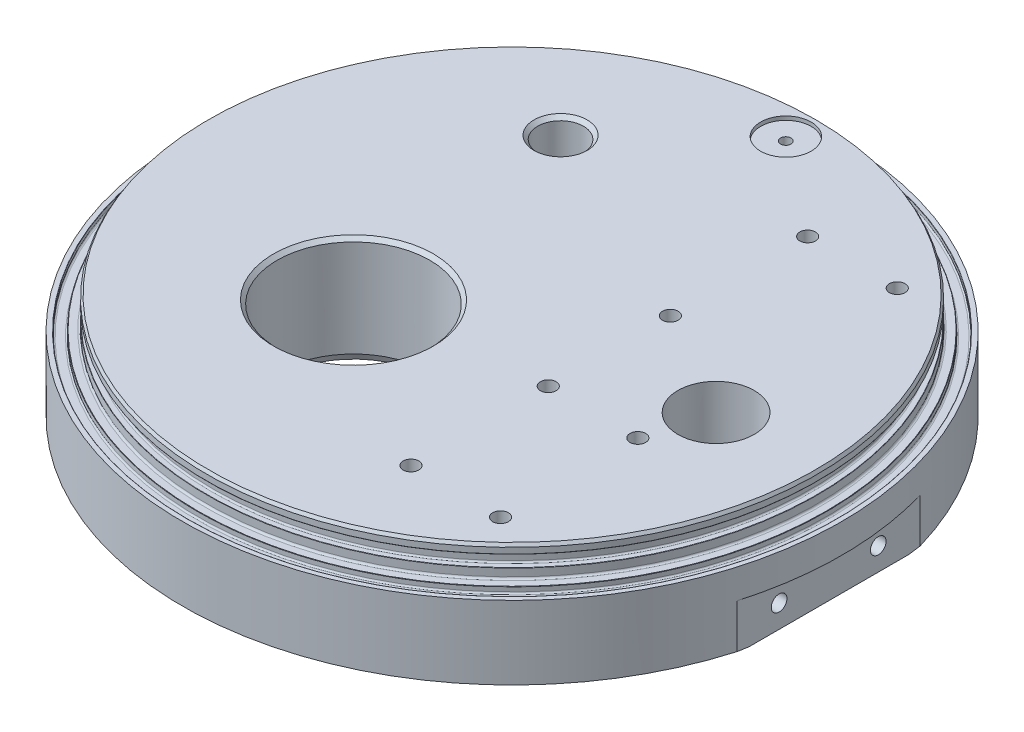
ISO-10303-21;
HEADER;
FILE_DESCRIPTION(('STEP AP214'),'2;1');
FILE_NAME('part.step','',(''),(''),'','','');
FILE_SCHEMA(('AUTOMOTIVE_DESIGN { 1 0 10303 214 1 1 1 1 }'));
ENDSEC;
DATA;
#1=APPLICATION_CONTEXT('core data for automotive mechanical design processes');
#2=APPLICATION_PROTOCOL_DEFINITION('international standard','automotive_design',2000,#1);
#3=PRODUCT_CONTEXT('',#1,'mechanical');
#4=PRODUCT('Part','Part','',(#3));
#5=PRODUCT_RELATED_PRODUCT_CATEGORY('part','',(#4));
#6=PRODUCT_DEFINITION_FORMATION('','',#4);
#7=PRODUCT_DEFINITION_CONTEXT('part definition',#1,'design');
#8=PRODUCT_DEFINITION('design','',#6,#7);
#9=PRODUCT_DEFINITION_SHAPE('','',#8);
#10=(LENGTH_UNIT() NAMED_UNIT(*) SI_UNIT(.MILLI.,.METRE.));
#11=(NAMED_UNIT(*) PLANE_ANGLE_UNIT() SI_UNIT($,.RADIAN.));
#12=(NAMED_UNIT(*) SI_UNIT($,.STERADIAN.) SOLID_ANGLE_UNIT());
#13=UNCERTAINTY_MEASURE_WITH_UNIT(LENGTH_MEASURE(1.E-05),#10,'distance_accuracy_value','');
#14=(GEOMETRIC_REPRESENTATION_CONTEXT(3) GLOBAL_UNCERTAINTY_ASSIGNED_CONTEXT((#13)) GLOBAL_UNIT_ASSIGNED_CONTEXT((#10,
#11,#12)) REPRESENTATION_CONTEXT('',''));
#15=CARTESIAN_POINT('',(0.,0.,0.));
#16=DIRECTION('',(0.,0.,1.));
#17=DIRECTION('',(1.,0.,0.));
#18=AXIS2_PLACEMENT_3D('',#15,#16,#17);
#19=CARTESIAN_POINT('',(-47.398610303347,2.03199999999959,-67.5787595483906));
#20=DIRECTION('',(0.,-1.,0.));
#21=DIRECTION('',(0.,0.,-1.));
#22=AXIS2_PLACEMENT_3D('',#19,#20,#21);
#23=CONICAL_SURFACE('',#22,9.52499999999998,0.261799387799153);
#24=CARTESIAN_POINT('',(-47.398610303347,2.03199999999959,-67.5787595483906));
#25=DIRECTION('',(0.,1.,0.));
#26=DIRECTION('',(0.,0.,1.));
#27=AXIS2_PLACEMENT_3D('',#24,#25,#26);
#28=CIRCLE('',#27,9.52499999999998);
#29=CARTESIAN_POINT('',(-47.398610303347,2.03199999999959,-58.0537595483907));
#30=VERTEX_POINT('',#29);
#31=EDGE_CURVE('E1127',#30,#30,#28,.F.);
#32=ORIENTED_EDGE('',*,*,#31,.F.);
#33=EDGE_LOOP('',(#32));
#34=FACE_BOUND('',#33,.T.);
#35=CARTESIAN_POINT('',(-47.398610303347,0.127,-67.5787595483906));
#36=DIRECTION('',(0.,-1.,0.));
#37=DIRECTION('',(0.,0.,-1.));
#38=AXIS2_PLACEMENT_3D('',#35,#36,#37);
#39=CIRCLE('',#38,10.0354432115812);
#40=CARTESIAN_POINT('',(-47.398610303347,0.127,-77.6142027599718));
#41=VERTEX_POINT('',#40);
#42=EDGE_CURVE('E826',#41,#41,#39,.T.);
#43=ORIENTED_EDGE('',*,*,#42,.T.);
#44=EDGE_LOOP('',(#43));
#45=FACE_BOUND('',#44,.T.);
#46=ADVANCED_FACE('F683',(#34,#45),#23,.F.);
#47=CARTESIAN_POINT('',(131.762117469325,19.05,38.1000000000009));
#48=DIRECTION('',(-1.,0.,0.));
#49=DIRECTION('',(0.,0.,1.));
#50=AXIS2_PLACEMENT_3D('',#47,#48,#49);
#51=PLANE('',#50);
#52=DIRECTION('',(0.,-1.,0.));
#53=VECTOR('',#52,1.);
#54=CARTESIAN_POINT('',(131.762117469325,19.05,-38.0999999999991));
#55=LINE('',#54,#53);
#56=CARTESIAN_POINT('',(131.762117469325,19.05,-38.0999999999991));
#57=VERTEX_POINT('',#56);
#58=CARTESIAN_POINT('',(131.762117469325,0.733234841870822,-38.0999999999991));
#59=VERTEX_POINT('',#58);
#60=EDGE_CURVE('E846',#57,#59,#55,.T.);
#61=ORIENTED_EDGE('',*,*,#60,.F.);
#62=DIRECTION('',(0.,0.,-1.));
#63=VECTOR('',#62,1.);
#64=CARTESIAN_POINT('',(131.762117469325,19.05,38.1000000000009));
#65=LINE('',#64,#63);
#66=CARTESIAN_POINT('',(131.762117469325,19.05,38.1000000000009));
#67=VERTEX_POINT('',#66);
#68=EDGE_CURVE('E697',#67,#57,#65,.T.);
#69=ORIENTED_EDGE('',*,*,#68,.F.);
#70=DIRECTION('',(0.,-1.,0.));
#71=VECTOR('',#70,1.);
#72=CARTESIAN_POINT('',(131.762117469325,19.05,38.1000000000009));
#73=LINE('',#72,#71);
#74=CARTESIAN_POINT('',(131.762117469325,0.733234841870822,38.1000000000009));
#75=VERTEX_POINT('',#74);
#76=EDGE_CURVE('E848',#67,#75,#73,.T.);
#77=ORIENTED_EDGE('',*,*,#76,.T.);
#78=CARTESIAN_POINT('',(131.762117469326,11.7056457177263,-83.8223166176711));
#79=CARTESIAN_POINT('',(131.762117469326,11.1769531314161,-82.1162476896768));
#80=CARTESIAN_POINT('',(131.762117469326,10.6587186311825,-80.406918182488));
#81=CARTESIAN_POINT('',(131.762117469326,9.6446719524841,-76.9815628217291));
#82=CARTESIAN_POINT('',(131.762117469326,9.14886051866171,-75.2655367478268));
#83=CARTESIAN_POINT('',(131.762117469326,8.181046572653,-71.8261760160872));
#84=CARTESIAN_POINT('',(131.762117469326,7.70905173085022,-70.102839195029));
#85=CARTESIAN_POINT('',(131.762117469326,6.79066496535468,-66.6493853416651));
#86=CARTESIAN_POINT('',(131.762117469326,6.34427281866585,-64.9192683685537));
#87=CARTESIAN_POINT('',(131.762117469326,5.0433912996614,-59.7083372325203));
#88=CARTESIAN_POINT('',(131.762117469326,4.23008014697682,-56.2171179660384));
#89=CARTESIAN_POINT('',(131.762117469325,2.72706391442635,-49.2082992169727));
#90=CARTESIAN_POINT('',(131.762117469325,2.03734712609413,-45.6907022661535));
#91=CARTESIAN_POINT('',(131.762117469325,1.11417838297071,-40.4440558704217));
#92=CARTESIAN_POINT('',(131.762117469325,0.828302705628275,-38.7241310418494));
#93=CARTESIAN_POINT('',(131.762117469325,0.290539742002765,-35.2789903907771));
#94=CARTESIAN_POINT('',(131.762117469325,0.0386516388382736,-33.5537746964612));
#95=CARTESIAN_POINT('',(131.762117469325,-0.429737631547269,-30.0984658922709));
#96=CARTESIAN_POINT('',(131.762117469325,-0.646237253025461,-28.3683725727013));
#97=CARTESIAN_POINT('',(131.762117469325,-1.04255536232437,-24.9040265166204));
#98=CARTESIAN_POINT('',(131.762117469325,-1.22237481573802,-23.1697738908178));
#99=CARTESIAN_POINT('',(131.762117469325,-1.54399729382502,-19.7002426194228));
#100=CARTESIAN_POINT('',(131.762117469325,-1.68585432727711,-17.964968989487));
#101=CARTESIAN_POINT('',(131.762117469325,-1.93098185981,-14.4916937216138));
#102=CARTESIAN_POINT('',(131.762117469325,-2.03425237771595,-12.7536920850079));
#103=CARTESIAN_POINT('',(131.762117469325,-2.20152532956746,-9.27580674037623));
#104=CARTESIAN_POINT('',(131.762117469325,-2.26552800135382,-7.53592304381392));
#105=CARTESIAN_POINT('',(131.762117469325,-2.35383570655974,-4.05514569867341));
#106=CARTESIAN_POINT('',(131.762117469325,-2.37814071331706,-2.31425204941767));
#107=CARTESIAN_POINT('',(131.762117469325,-2.38694558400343,1.19085112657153));
#108=CARTESIAN_POINT('',(131.762117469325,-2.37091036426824,2.95506202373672));
#109=CARTESIAN_POINT('',(131.762117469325,-2.29801796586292,6.48263930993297));
#110=CARTESIAN_POINT('',(131.762117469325,-2.24116075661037,8.24600569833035));
#111=CARTESIAN_POINT('',(131.762117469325,-2.08701764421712,11.7709860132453));
#112=CARTESIAN_POINT('',(131.762117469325,-1.98973130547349,13.5325999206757));
#113=CARTESIAN_POINT('',(131.762117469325,-1.75539169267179,17.0531752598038));
#114=CARTESIAN_POINT('',(131.762117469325,-1.61833841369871,18.8121366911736));
#115=CARTESIAN_POINT('',(131.762117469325,-1.30513954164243,22.3291934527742));
#116=CARTESIAN_POINT('',(131.762117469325,-1.12893638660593,24.0872836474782));
#117=CARTESIAN_POINT('',(131.762117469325,-0.738680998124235,27.5992488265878));
#118=CARTESIAN_POINT('',(131.762117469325,-0.524628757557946,29.3531238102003));
#119=CARTESIAN_POINT('',(131.762117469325,-0.0599873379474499,32.8559651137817));
#120=CARTESIAN_POINT('',(131.762117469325,0.190600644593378,34.6049315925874));
#121=CARTESIAN_POINT('',(131.762117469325,0.726866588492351,38.0974917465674));
#122=CARTESIAN_POINT('',(131.762117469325,1.01254542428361,39.8410852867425));
#123=CARTESIAN_POINT('',(131.762117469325,1.93693681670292,45.1611159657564));
#124=CARTESIAN_POINT('',(131.762117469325,2.62982170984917,48.7282448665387));
#125=CARTESIAN_POINT('',(131.762117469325,4.14318226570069,55.8354713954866));
#126=CARTESIAN_POINT('',(131.762117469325,4.96367065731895,59.3755662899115));
#127=CARTESIAN_POINT('',(131.762117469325,6.27783938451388,64.6590732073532));
#128=CARTESIAN_POINT('',(131.762117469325,6.72905881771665,66.4131782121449));
#129=CARTESIAN_POINT('',(131.762117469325,7.65787425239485,69.9144209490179));
#130=CARTESIAN_POINT('',(131.762117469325,8.13547049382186,71.6615586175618));
#131=CARTESIAN_POINT('',(131.762117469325,9.11518223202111,75.1482983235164));
#132=CARTESIAN_POINT('',(131.762117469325,9.61728946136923,76.8879026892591));
#133=CARTESIAN_POINT('',(131.762117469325,10.6445652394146,80.3602269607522));
#134=CARTESIAN_POINT('',(131.762117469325,11.1697329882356,82.0929471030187));
#135=CARTESIAN_POINT('',(131.762117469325,11.7056457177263,83.8223166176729));
#136=B_SPLINE_CURVE_WITH_KNOTS('',3,(#78,#79,#80,#81,#82,#83,#84,#85,#86,#87,#88,#89,#90,#91,
#92,#93,#94,#95,#96,#97,#98,#99,#100,#101,#102,#103,#104,#105,#106,#107,#108,#109,#110,#111,
#112,#113,#114,#115,#116,#117,#118,#119,#120,#121,#122,#123,#124,#125,#126,#127,#128,#129,#130,
#131,#132,#133,#134,#135),.UNSPECIFIED.,.F.,.F.,(4,2,2,2,2,2,2,2,2,2,2,2,2,2,2,2,2,2,2,2,2,2,2,
2,2,2,2,2,4),(0.,5.35832147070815,10.716820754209,16.0770349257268,21.4372024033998,
32.1892510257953,42.9402805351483,48.1705627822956,53.400719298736,58.6311042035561,
63.8613514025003,69.0841175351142,74.3068811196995,79.5296130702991,84.7523485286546,
90.0447240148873,95.3371034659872,100.629539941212,105.921977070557,111.222247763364,
116.52251945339,121.822617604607,127.122847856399,138.021402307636,148.921044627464,
154.354506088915,159.788016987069,165.219707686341,170.651210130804),.UNSPECIFIED.);
#137=CARTESIAN_POINT('',(131.762117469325,0.,33.2390809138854));
#138=VERTEX_POINT('',#137);
#139=EDGE_CURVE('E850',#138,#75,#136,.T.);
#140=ORIENTED_EDGE('',*,*,#139,.F.);
#141=DIRECTION('',(0.,0.,-1.));
#142=VECTOR('',#141,1.);
#143=CARTESIAN_POINT('',(131.762117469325,0.,38.1000000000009));
#144=LINE('',#143,#142);
#145=CARTESIAN_POINT('',(131.762117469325,0.,-33.2390809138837));
#146=VERTEX_POINT('',#145);
#147=EDGE_CURVE('E844',#138,#146,#144,.T.);
#148=ORIENTED_EDGE('',*,*,#147,.T.);
#149=EDGE_CURVE('E860',#59,#146,#136,.T.);
#150=ORIENTED_EDGE('',*,*,#149,.F.);
#151=EDGE_LOOP('',(#61,#69,#77,#140,#148,#150));
#152=FACE_BOUND('',#151,.T.);
#153=CARTESIAN_POINT('',(131.762117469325,9.525,-20.6374999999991));
#154=DIRECTION('',(1.,0.,0.));
#155=DIRECTION('',(0.,0.,-1.));
#156=AXIS2_PLACEMENT_3D('',#153,#154,#155);
#157=CIRCLE('',#156,3.26389999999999);
#158=CARTESIAN_POINT('',(131.762117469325,9.525,-23.9013999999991));
#159=VERTEX_POINT('',#158);
#160=EDGE_CURVE('E819',#159,#159,#157,.T.);
#161=ORIENTED_EDGE('',*,*,#160,.F.);
#162=EDGE_LOOP('',(#161));
#163=FACE_BOUND('',#162,.T.);
#164=CARTESIAN_POINT('',(131.762117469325,9.525,20.6375000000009));
#165=DIRECTION('',(1.,0.,0.));
#166=DIRECTION('',(0.,0.,-1.));
#167=AXIS2_PLACEMENT_3D('',#164,#165,#166);
#168=CIRCLE('',#167,3.26389999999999);
#169=CARTESIAN_POINT('',(131.762117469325,9.525,17.3736000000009));
#170=VERTEX_POINT('',#169);
#171=EDGE_CURVE('E820',#170,#170,#168,.T.);
#172=ORIENTED_EDGE('',*,*,#171,.F.);
#173=EDGE_LOOP('',(#172));
#174=FACE_BOUND('',#173,.T.);
#175=ADVANCED_FACE('F866',(#152,#163,#174),#51,.F.);
#176=CARTESIAN_POINT('',(-131.762117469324,19.05,38.1));
#177=DIRECTION('',(1.,0.,0.));
#178=DIRECTION('',(0.,0.,-1.));
#179=AXIS2_PLACEMENT_3D('',#176,#177,#178);
#180=PLANE('',#179);
#181=CARTESIAN_POINT('',(-131.762117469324,9.525,20.6375));
#182=DIRECTION('',(-1.,0.,0.));
#183=DIRECTION('',(0.,0.,1.));
#184=AXIS2_PLACEMENT_3D('',#181,#182,#183);
#185=CIRCLE('',#184,3.26389999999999);
#186=CARTESIAN_POINT('',(-131.762117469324,9.525,23.9014));
#187=VERTEX_POINT('',#186);
#188=EDGE_CURVE('E832',#187,#187,#185,.T.);
#189=ORIENTED_EDGE('',*,*,#188,.F.);
#190=EDGE_LOOP('',(#189));
#191=FACE_BOUND('',#190,.T.);
#192=DIRECTION('',(0.,-1.,0.));
#193=VECTOR('',#192,1.);
#194=CARTESIAN_POINT('',(-131.762117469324,19.05,38.1));
#195=LINE('',#194,#193);
#196=CARTESIAN_POINT('',(-131.762117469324,19.05,38.1));
#197=VERTEX_POINT('',#196);
#198=CARTESIAN_POINT('',(-131.762117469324,0.733234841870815,38.1));
#199=VERTEX_POINT('',#198);
#200=EDGE_CURVE('E896',#197,#199,#195,.T.);
#201=ORIENTED_EDGE('',*,*,#200,.F.);
#202=DIRECTION('',(0.,0.,1.));
#203=VECTOR('',#202,1.);
#204=CARTESIAN_POINT('',(-131.762117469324,19.05,38.1));
#205=LINE('',#204,#203);
#206=CARTESIAN_POINT('',(-131.762117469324,19.05,-38.1));
#207=VERTEX_POINT('',#206);
#208=EDGE_CURVE('E704',#207,#197,#205,.T.);
#209=ORIENTED_EDGE('',*,*,#208,.F.);
#210=DIRECTION('',(0.,-1.,0.));
#211=VECTOR('',#210,1.);
#212=CARTESIAN_POINT('',(-131.762117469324,19.05,-38.1));
#213=LINE('',#212,#211);
#214=CARTESIAN_POINT('',(-131.762117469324,0.733234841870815,-38.1));
#215=VERTEX_POINT('',#214);
#216=EDGE_CURVE('E895',#207,#215,#213,.T.);
#217=ORIENTED_EDGE('',*,*,#216,.T.);
#218=CARTESIAN_POINT('',(-131.762117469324,11.7056457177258,83.822316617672));
#219=CARTESIAN_POINT('',(-131.762117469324,11.1769531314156,82.1162476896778));
#220=CARTESIAN_POINT('',(-131.762117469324,10.6587186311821,80.406918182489));
#221=CARTESIAN_POINT('',(-131.762117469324,9.64467195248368,76.9815628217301));
#222=CARTESIAN_POINT('',(-131.762117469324,9.14886051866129,75.2655367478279));
#223=CARTESIAN_POINT('',(-131.762117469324,8.18104657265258,71.8261760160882));
#224=CARTESIAN_POINT('',(-131.762117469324,7.7090517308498,70.1028391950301));
#225=CARTESIAN_POINT('',(-131.762117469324,6.79066496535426,66.6493853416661));
#226=CARTESIAN_POINT('',(-131.762117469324,6.34427281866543,64.9192683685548));
#227=CARTESIAN_POINT('',(-131.762117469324,5.04339129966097,59.7083372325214));
#228=CARTESIAN_POINT('',(-131.762117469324,4.23008014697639,56.2171179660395));
#229=CARTESIAN_POINT('',(-131.762117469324,2.72706391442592,49.2082992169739));
#230=CARTESIAN_POINT('',(-131.762117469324,2.03734712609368,45.6907022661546));
#231=CARTESIAN_POINT('',(-131.762117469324,1.11417838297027,40.4440558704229));
#232=CARTESIAN_POINT('',(-131.762117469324,0.828302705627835,38.7241310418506));
#233=CARTESIAN_POINT('',(-131.762117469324,0.290539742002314,35.2789903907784));
#234=CARTESIAN_POINT('',(-131.762117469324,0.0386516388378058,33.5537746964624));
#235=CARTESIAN_POINT('',(-131.762117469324,-0.429737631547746,30.0984658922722));
#236=CARTESIAN_POINT('',(-131.762117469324,-0.646237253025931,28.3683725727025));
#237=CARTESIAN_POINT('',(-131.762117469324,-1.04255536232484,24.9040265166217));
#238=CARTESIAN_POINT('',(-131.762117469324,-1.2223748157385,23.1697738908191));
#239=CARTESIAN_POINT('',(-131.762117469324,-1.54399729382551,19.7002426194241));
#240=CARTESIAN_POINT('',(-131.762117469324,-1.6858543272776,17.9649689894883));
#241=CARTESIAN_POINT('',(-131.762117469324,-1.9309818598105,14.4916937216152));
#242=CARTESIAN_POINT('',(-131.762117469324,-2.03425237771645,12.7536920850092));
#243=CARTESIAN_POINT('',(-131.762117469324,-2.20152532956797,9.27580674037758));
#244=CARTESIAN_POINT('',(-131.762117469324,-2.26552800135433,7.53592304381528));
#245=CARTESIAN_POINT('',(-131.762117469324,-2.35383570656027,4.05514569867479));
#246=CARTESIAN_POINT('',(-131.762117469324,-2.37814071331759,2.31425204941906));
#247=CARTESIAN_POINT('',(-131.762117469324,-2.38694558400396,-1.19085112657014));
#248=CARTESIAN_POINT('',(-131.762117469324,-2.37091036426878,-2.95506202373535));
#249=CARTESIAN_POINT('',(-131.762117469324,-2.29801796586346,-6.48263930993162));
#250=CARTESIAN_POINT('',(-131.762117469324,-2.24116075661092,-8.24600569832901));
#251=CARTESIAN_POINT('',(-131.762117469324,-2.08701764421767,-11.770986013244));
#252=CARTESIAN_POINT('',(-131.762117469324,-1.98973130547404,-13.5325999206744));
#253=CARTESIAN_POINT('',(-131.762117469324,-1.75539169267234,-17.0531752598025));
#254=CARTESIAN_POINT('',(-131.762117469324,-1.61833841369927,-18.8121366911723));
#255=CARTESIAN_POINT('',(-131.762117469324,-1.305139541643,-22.3291934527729));
#256=CARTESIAN_POINT('',(-131.762117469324,-1.12893638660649,-24.0872836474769));
#257=CARTESIAN_POINT('',(-131.762117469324,-0.738680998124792,-27.5992488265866));
#258=CARTESIAN_POINT('',(-131.762117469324,-0.524628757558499,-29.3531238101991));
#259=CARTESIAN_POINT('',(-131.762117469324,-0.0599873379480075,-32.8559651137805));
#260=CARTESIAN_POINT('',(-131.762117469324,0.190600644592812,-34.6049315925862));
#261=CARTESIAN_POINT('',(-131.762117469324,0.726866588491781,-38.0974917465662));
#262=CARTESIAN_POINT('',(-131.762117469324,1.01254542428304,-39.8410852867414));
#263=CARTESIAN_POINT('',(-131.762117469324,1.93693681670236,-45.1611159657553));
#264=CARTESIAN_POINT('',(-131.762117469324,2.62982170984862,-48.7282448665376));
#265=CARTESIAN_POINT('',(-131.762117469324,4.14318226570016,-55.8354713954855));
#266=CARTESIAN_POINT('',(-131.762117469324,4.96367065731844,-59.3755662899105));
#267=CARTESIAN_POINT('',(-131.762117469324,6.27783938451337,-64.6590732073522));
#268=CARTESIAN_POINT('',(-131.762117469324,6.72905881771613,-66.4131782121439));
#269=CARTESIAN_POINT('',(-131.762117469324,7.65787425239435,-69.9144209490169));
#270=CARTESIAN_POINT('',(-131.762117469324,8.13547049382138,-71.6615586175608));
#271=CARTESIAN_POINT('',(-131.762117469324,9.11518223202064,-75.1482983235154));
#272=CARTESIAN_POINT('',(-131.762117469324,9.61728946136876,-76.8879026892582));
#273=CARTESIAN_POINT('',(-131.762117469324,10.6445652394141,-80.3602269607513));
#274=CARTESIAN_POINT('',(-131.762117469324,11.1697329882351,-82.0929471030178));
#275=CARTESIAN_POINT('',(-131.762117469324,11.7056457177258,-83.822316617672));
#276=B_SPLINE_CURVE_WITH_KNOTS('',3,(#218,#219,#220,#221,#222,#223,#224,#225,#226,#227,#228,
#229,#230,#231,#232,#233,#234,#235,#236,#237,#238,#239,#240,#241,#242,#243,#244,#245,#246,#247,
#248,#249,#250,#251,#252,#253,#254,#255,#256,#257,#258,#259,#260,#261,#262,#263,#264,#265,#266,
#267,#268,#269,#270,#271,#272,#273,#274,#275),.UNSPECIFIED.,.F.,.F.,(4,2,2,2,2,2,2,2,2,2,2,2,2,
2,2,2,2,2,2,2,2,2,2,2,2,2,2,2,4),(0.,5.35832147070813,10.716820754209,16.0770349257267,
21.4372024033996,32.1892510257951,42.9402805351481,48.1705627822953,53.4007192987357,
58.6311042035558,63.8613514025,69.0841175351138,74.3068811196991,79.5296130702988,
84.7523485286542,90.0447240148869,95.3371034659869,100.629539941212,105.921977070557,
111.222247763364,116.522519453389,121.822617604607,127.122847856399,138.021402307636,
148.921044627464,154.354506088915,159.788016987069,165.219707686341,170.651210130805),.UNSPECIFIED.);
#277=CARTESIAN_POINT('',(-131.762117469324,0.,-33.2390809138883));
#278=VERTEX_POINT('',#277);
#279=EDGE_CURVE('E887',#278,#215,#276,.T.);
#280=ORIENTED_EDGE('',*,*,#279,.F.);
#281=DIRECTION('',(0.,0.,1.));
#282=VECTOR('',#281,1.);
#283=CARTESIAN_POINT('',(-131.762117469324,0.,38.1));
#284=LINE('',#283,#282);
#285=CARTESIAN_POINT('',(-131.762117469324,0.,33.2390809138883));
#286=VERTEX_POINT('',#285);
#287=EDGE_CURVE('E1166',#278,#286,#284,.T.);
#288=ORIENTED_EDGE('',*,*,#287,.T.);
#289=EDGE_CURVE('E894',#199,#286,#276,.T.);
#290=ORIENTED_EDGE('',*,*,#289,.F.);
#291=EDGE_LOOP('',(#201,#209,#217,#280,#288,#290));
#292=FACE_BOUND('',#291,.T.);
#293=CARTESIAN_POINT('',(-131.762117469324,9.525,-20.6375));
#294=DIRECTION('',(-1.,0.,0.));
#295=DIRECTION('',(0.,0.,1.));
#296=AXIS2_PLACEMENT_3D('',#293,#294,#295);
#297=CIRCLE('',#296,3.26389999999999);
#298=CARTESIAN_POINT('',(-131.762117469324,9.525,-17.3736));
#299=VERTEX_POINT('',#298);
#300=EDGE_CURVE('E838',#299,#299,#297,.T.);
#301=ORIENTED_EDGE('',*,*,#300,.F.);
#302=EDGE_LOOP('',(#301));
#303=FACE_BOUND('',#302,.T.);
#304=ADVANCED_FACE('F871',(#191,#292,#303),#180,.F.);
#305=CARTESIAN_POINT('',(0.,0.733234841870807,0.));
#306=DIRECTION('',(0.,1.,0.));
#307=DIRECTION('',(0.,0.,1.));
#308=AXIS2_PLACEMENT_3D('',#305,#306,#307);
#309=CONICAL_SURFACE('',#308,137.16,1.0471975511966);
#310=CARTESIAN_POINT('',(0.,0.733234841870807,0.));
#311=DIRECTION('',(0.,-1.,0.));
#312=DIRECTION('',(0.,0.,-1.));
#313=AXIS2_PLACEMENT_3D('',#310,#311,#312);
#314=CIRCLE('',#313,137.16);
#315=EDGE_CURVE('E1117',#215,#59,#314,.T.);
#316=ORIENTED_EDGE('',*,*,#315,.T.);
#317=ORIENTED_EDGE('',*,*,#149,.T.);
#318=CARTESIAN_POINT('',(0.,0.,0.));
#319=DIRECTION('',(0.,-1.,0.));
#320=DIRECTION('',(0.,0.,-1.));
#321=AXIS2_PLACEMENT_3D('',#318,#319,#320);
#322=CIRCLE('',#321,135.89);
#323=EDGE_CURVE('E1121',#278,#146,#322,.T.);
#324=ORIENTED_EDGE('',*,*,#323,.F.);
#325=ORIENTED_EDGE('',*,*,#279,.T.);
#326=EDGE_LOOP('',(#316,#317,#324,#325));
#327=FACE_BOUND('',#326,.T.);
#328=ADVANCED_FACE('F882',(#327),#309,.T.);
#329=CARTESIAN_POINT('',(-31.0918224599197,2.54000000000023,34.9125790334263));
#330=DIRECTION('',(0.,-1.,0.));
#331=DIRECTION('',(0.,0.,-1.));
#332=AXIS2_PLACEMENT_3D('',#329,#330,#331);
#333=CONICAL_SURFACE('',#332,31.75,0.314159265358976);
#334=CARTESIAN_POINT('',(-31.0918224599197,2.54000000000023,34.9125790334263));
#335=DIRECTION('',(0.,1.,0.));
#336=DIRECTION('',(0.,0.,1.));
#337=AXIS2_PLACEMENT_3D('',#334,#335,#336);
#338=CIRCLE('',#337,31.75);
#339=CARTESIAN_POINT('',(-31.0918224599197,2.54000000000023,66.6625790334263));
#340=VERTEX_POINT('',#339);
#341=EDGE_CURVE('E1124',#340,#340,#338,.F.);
#342=ORIENTED_EDGE('',*,*,#341,.F.);
#343=EDGE_LOOP('',(#342));
#344=FACE_BOUND('',#343,.T.);
#345=CARTESIAN_POINT('',(-31.0918224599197,0.127,34.9125790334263));
#346=DIRECTION('',(0.,-1.,0.));
#347=DIRECTION('',(0.,0.,-1.));
#348=AXIS2_PLACEMENT_3D('',#345,#346,#347);
#349=CIRCLE('',#348,32.5340312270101);
#350=CARTESIAN_POINT('',(-31.0918224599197,0.127,2.37854780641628));
#351=VERTEX_POINT('',#350);
#352=EDGE_CURVE('E901',#351,#351,#349,.T.);
#353=ORIENTED_EDGE('',*,*,#352,.T.);
#354=EDGE_LOOP('',(#353));
#355=FACE_BOUND('',#354,.T.);
#356=ADVANCED_FACE('F1204',(#344,#355),#333,.F.);
#357=CARTESIAN_POINT('',(0.,0.,-113.903708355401));
#358=DIRECTION('',(0.,-1.,0.));
#359=DIRECTION('',(0.,0.,-1.));
#360=AXIS2_PLACEMENT_3D('',#357,#358,#359);
#361=CONICAL_SURFACE('',#360,6.1849,0.20943951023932);
#362=CARTESIAN_POINT('',(0.,2.3622,-113.903708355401));
#363=DIRECTION('',(0.,-1.,0.));
#364=DIRECTION('',(0.,0.,-1.));
#365=AXIS2_PLACEMENT_3D('',#362,#363,#364);
#366=CIRCLE('',#365,5.68279889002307);
#367=CARTESIAN_POINT('',(0.,2.3622,-119.586507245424));
#368=VERTEX_POINT('',#367);
#369=EDGE_CURVE('E930',#368,#368,#366,.T.);
#370=ORIENTED_EDGE('',*,*,#369,.F.);
#371=EDGE_LOOP('',(#370));
#372=FACE_BOUND('',#371,.T.);
#373=CARTESIAN_POINT('',(0.,0.254,-113.903708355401));
#374=DIRECTION('',(0.,-1.,0.));
#375=DIRECTION('',(0.,0.,-1.));
#376=AXIS2_PLACEMENT_3D('',#373,#374,#375);
#377=CIRCLE('',#376,6.13091063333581);
#378=CARTESIAN_POINT('',(0.,0.254,-120.034618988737));
#379=VERTEX_POINT('',#378);
#380=EDGE_CURVE('E927',#379,#379,#377,.F.);
#381=ORIENTED_EDGE('',*,*,#380,.F.);
#382=EDGE_LOOP('',(#381));
#383=FACE_BOUND('',#382,.T.);
#384=ADVANCED_FACE('F1329',(#372,#383),#361,.F.);
#385=CARTESIAN_POINT('',(84.8951691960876,0.508000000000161,0.));
#386=DIRECTION('',(0.,-1.,0.));
#387=DIRECTION('',(0.,0.,-1.));
#388=AXIS2_PLACEMENT_3D('',#385,#386,#387);
#389=CONICAL_SURFACE('',#388,15.875,0.349065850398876);
#390=CARTESIAN_POINT('',(84.8951691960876,0.508000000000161,0.));
#391=DIRECTION('',(0.,1.,0.));
#392=DIRECTION('',(0.,0.,1.));
#393=AXIS2_PLACEMENT_3D('',#390,#391,#392);
#394=CIRCLE('',#393,15.875);
#395=CARTESIAN_POINT('',(84.8951691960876,0.508000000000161,15.875));
#396=VERTEX_POINT('',#395);
#397=EDGE_CURVE('E1142',#396,#396,#394,.F.);
#398=ORIENTED_EDGE('',*,*,#397,.F.);
#399=EDGE_LOOP('',(#398));
#400=FACE_BOUND('',#399,.T.);
#401=CARTESIAN_POINT('',(84.8951691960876,0.0254,0.));
#402=DIRECTION('',(0.,-1.,0.));
#403=DIRECTION('',(1.,0.,0.));
#404=AXIS2_PLACEMENT_3D('',#401,#402,#403);
#405=CIRCLE('',#404,16.0506520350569);
#406=CARTESIAN_POINT('',(100.945821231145,0.0254,0.));
#407=VERTEX_POINT('',#406);
#408=EDGE_CURVE('E1017',#407,#407,#405,.T.);
#409=ORIENTED_EDGE('',*,*,#408,.T.);
#410=EDGE_LOOP('',(#409));
#411=FACE_BOUND('',#410,.T.);
#412=ADVANCED_FACE('F685',(#400,#411),#389,.F.);
#413=CARTESIAN_POINT('',(0.,0.,0.));
#414=DIRECTION('',(0.,1.,0.));
#415=DIRECTION('',(0.,0.,1.));
#416=AXIS2_PLACEMENT_3D('',#413,#414,#415);
#417=PLANE('',#416);
#418=CARTESIAN_POINT('',(-47.398610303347,0.,-67.5787595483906));
#419=DIRECTION('',(0.,-1.,0.));
#420=DIRECTION('',(0.,0.,-1.));
#421=AXIS2_PLACEMENT_3D('',#418,#419,#420);
#422=CIRCLE('',#421,22.225);
#423=CARTESIAN_POINT('',(-47.398610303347,0.,-89.8037595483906));
#424=VERTEX_POINT('',#423);
#425=EDGE_CURVE('E2205',#424,#424,#422,.T.);
#426=ORIENTED_EDGE('',*,*,#425,.F.);
#427=EDGE_LOOP('',(#426));
#428=FACE_BOUND('',#427,.T.);
#429=CARTESIAN_POINT('',(-31.0918224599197,0.,34.9125790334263));
#430=DIRECTION('',(0.,-1.,0.));
#431=DIRECTION('',(0.,0.,-1.));
#432=AXIS2_PLACEMENT_3D('',#429,#430,#431);
#433=CIRCLE('',#432,57.531);
#434=CARTESIAN_POINT('',(-31.0918224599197,0.,-22.6184209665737));
#435=VERTEX_POINT('',#434);
#436=EDGE_CURVE('E902',#435,#435,#433,.T.);
#437=ORIENTED_EDGE('',*,*,#436,.F.);
#438=EDGE_LOOP('',(#437));
#439=FACE_BOUND('',#438,.T.);
#440=CARTESIAN_POINT('',(0.,0.,-113.903708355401));
#441=DIRECTION('',(0.,-1.,0.));
#442=DIRECTION('',(0.,0.,-1.));
#443=AXIS2_PLACEMENT_3D('',#440,#441,#442);
#444=CIRCLE('',#443,10.5156);
#445=CARTESIAN_POINT('',(0.,0.,-124.419308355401));
#446=VERTEX_POINT('',#445);
#447=EDGE_CURVE('E923',#446,#446,#444,.T.);
#448=ORIENTED_EDGE('',*,*,#447,.F.);
#449=EDGE_LOOP('',(#448));
#450=FACE_BOUND('',#449,.T.);
#451=CARTESIAN_POINT('',(84.8951691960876,0.,0.));
#452=DIRECTION('',(0.,-1.,0.));
#453=DIRECTION('',(1.,0.,0.));
#454=AXIS2_PLACEMENT_3D('',#451,#452,#453);
#455=CIRCLE('',#454,33.274);
#456=CARTESIAN_POINT('',(118.169169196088,0.,0.));
#457=VERTEX_POINT('',#456);
#458=EDGE_CURVE('E1013',#457,#457,#455,.T.);
#459=ORIENTED_EDGE('',*,*,#458,.F.);
#460=EDGE_LOOP('',(#459));
#461=FACE_BOUND('',#460,.T.);
#462=ORIENTED_EDGE('',*,*,#323,.T.);
#463=ORIENTED_EDGE('',*,*,#147,.F.);
#464=EDGE_CURVE('E1120',#138,#286,#322,.T.);
#465=ORIENTED_EDGE('',*,*,#464,.T.);
#466=ORIENTED_EDGE('',*,*,#287,.F.);
#467=EDGE_LOOP('',(#462,#463,#465,#466));
#468=FACE_BOUND('',#467,.T.);
#469=ADVANCED_FACE('F1175',(#428,#439,#450,#461,#468),#417,.F.);
#470=ORIENTED_EDGE('',*,*,#464,.F.);
#471=ORIENTED_EDGE('',*,*,#139,.T.);
#472=EDGE_CURVE('E1116',#75,#199,#314,.T.);
#473=ORIENTED_EDGE('',*,*,#472,.T.);
#474=ORIENTED_EDGE('',*,*,#289,.T.);
#475=EDGE_LOOP('',(#470,#471,#473,#474));
#476=FACE_BOUND('',#475,.T.);
#477=ADVANCED_FACE('F862',(#476),#309,.T.);
#478=CARTESIAN_POINT('',(0.,0.,0.));
#479=DIRECTION('',(0.,-1.,0.));
#480=DIRECTION('',(0.,0.,-1.));
#481=AXIS2_PLACEMENT_3D('',#478,#479,#480);
#482=CYLINDRICAL_SURFACE('',#481,137.16);
#483=ORIENTED_EDGE('',*,*,#472,.F.);
#484=ORIENTED_EDGE('',*,*,#76,.F.);
#485=CARTESIAN_POINT('',(0.,19.05,0.));
#486=DIRECTION('',(0.,-1.,0.));
#487=DIRECTION('',(0.,0.,-1.));
#488=AXIS2_PLACEMENT_3D('',#485,#486,#487);
#489=CIRCLE('',#488,137.16);
#490=EDGE_CURVE('E12',#57,#67,#489,.T.);
#491=ORIENTED_EDGE('',*,*,#490,.F.);
#492=ORIENTED_EDGE('',*,*,#60,.T.);
#493=ORIENTED_EDGE('',*,*,#315,.F.);
#494=ORIENTED_EDGE('',*,*,#216,.F.);
#495=CARTESIAN_POINT('',(0.,19.05,0.));
#496=DIRECTION('',(0.,1.,0.));
#497=DIRECTION('',(0.,0.,1.));
#498=AXIS2_PLACEMENT_3D('',#495,#496,#497);
#499=CIRCLE('',#498,137.16);
#500=EDGE_CURVE('E692',#207,#197,#499,.T.);
#501=ORIENTED_EDGE('',*,*,#500,.T.);
#502=ORIENTED_EDGE('',*,*,#200,.T.);
#503=EDGE_LOOP('',(#483,#484,#491,#492,#493,#494,#501,#502));
#504=FACE_BOUND('',#503,.T.);
#505=CARTESIAN_POINT('',(0.,31.242,0.));
#506=DIRECTION('',(0.,-1.,0.));
#507=DIRECTION('',(0.,0.,-1.));
#508=AXIS2_PLACEMENT_3D('',#505,#506,#507);
#509=CIRCLE('',#508,137.16);
#510=CARTESIAN_POINT('',(0.,31.242,-137.16));
#511=VERTEX_POINT('',#510);
#512=EDGE_CURVE('E1113',#511,#511,#509,.T.);
#513=ORIENTED_EDGE('',*,*,#512,.T.);
#514=EDGE_LOOP('',(#513));
#515=FACE_BOUND('',#514,.T.);
#516=ADVANCED_FACE('F1160',(#504,#515),#482,.T.);
#517=CARTESIAN_POINT('',(-135.255,31.242,0.));
#518=DIRECTION('',(0.,-1.,0.));
#519=DIRECTION('',(0.,0.,-1.));
#520=AXIS2_PLACEMENT_3D('',#517,#518,#519);
#521=PLANE('',#520);
#522=ORIENTED_EDGE('',*,*,#512,.F.);
#523=EDGE_LOOP('',(#522));
#524=FACE_BOUND('',#523,.T.);
#525=CARTESIAN_POINT('',(0.,31.242,0.));
#526=DIRECTION('',(0.,-1.,0.));
#527=DIRECTION('',(0.,0.,-1.));
#528=AXIS2_PLACEMENT_3D('',#525,#526,#527);
#529=CIRCLE('',#528,135.255);
#530=CARTESIAN_POINT('',(0.,31.242,-135.255));
#531=VERTEX_POINT('',#530);
#532=EDGE_CURVE('E1110',#531,#531,#529,.T.);
#533=ORIENTED_EDGE('',*,*,#532,.T.);
#534=EDGE_LOOP('',(#533));
#535=FACE_BOUND('',#534,.T.);
#536=ADVANCED_FACE('F1313',(#524,#535),#521,.F.);
#537=CARTESIAN_POINT('',(0.,31.115,0.));
#538=DIRECTION('',(0.,-1.,0.));
#539=DIRECTION('',(0.,0.,-1.));
#540=AXIS2_PLACEMENT_3D('',#537,#538,#539);
#541=TOROIDAL_SURFACE('',#540,135.255,0.127000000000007);
#542=ORIENTED_EDGE('',*,*,#532,.F.);
#543=EDGE_LOOP('',(#542));
#544=FACE_BOUND('',#543,.T.);
#545=CARTESIAN_POINT('',(0.,31.115,0.));
#546=DIRECTION('',(0.,-1.,0.));
#547=DIRECTION('',(0.,0.,-1.));
#548=AXIS2_PLACEMENT_3D('',#545,#546,#547);
#549=CIRCLE('',#548,135.128);
#550=CARTESIAN_POINT('',(0.,31.115,-135.128));
#551=VERTEX_POINT('',#550);
#552=EDGE_CURVE('E1107',#551,#551,#549,.T.);
#553=ORIENTED_EDGE('',*,*,#552,.T.);
#554=EDGE_LOOP('',(#553));
#555=FACE_BOUND('',#554,.T.);
#556=ADVANCED_FACE('F1309',(#544,#555),#541,.T.);
#557=CARTESIAN_POINT('',(0.,0.,0.));
#558=DIRECTION('',(0.,-1.,0.));
#559=DIRECTION('',(0.,0.,-1.));
#560=AXIS2_PLACEMENT_3D('',#557,#558,#559);
#561=CYLINDRICAL_SURFACE('',#560,135.128);
#562=ORIENTED_EDGE('',*,*,#552,.F.);
#563=EDGE_LOOP('',(#562));
#564=FACE_BOUND('',#563,.T.);
#565=CARTESIAN_POINT('',(0.,29.8196,0.));
#566=DIRECTION('',(0.,-1.,0.));
#567=DIRECTION('',(0.,0.,-1.));
#568=AXIS2_PLACEMENT_3D('',#565,#566,#567);
#569=CIRCLE('',#568,135.128);
#570=CARTESIAN_POINT('',(0.,29.8196,-135.128));
#571=VERTEX_POINT('',#570);
#572=EDGE_CURVE('E1104',#571,#571,#569,.T.);
#573=ORIENTED_EDGE('',*,*,#572,.T.);
#574=EDGE_LOOP('',(#573));
#575=FACE_BOUND('',#574,.T.);
#576=ADVANCED_FACE('F1305',(#564,#575),#561,.F.);
#577=CARTESIAN_POINT('',(0.,29.8196,0.));
#578=DIRECTION('',(0.,-1.,0.));
#579=DIRECTION('',(0.,0.,-1.));
#580=AXIS2_PLACEMENT_3D('',#577,#578,#579);
#581=TOROIDAL_SURFACE('',#580,134.493,0.634999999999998);
#582=ORIENTED_EDGE('',*,*,#572,.F.);
#583=EDGE_LOOP('',(#582));
#584=FACE_BOUND('',#583,.T.);
#585=CARTESIAN_POINT('',(0.,29.1846,0.));
#586=DIRECTION('',(0.,-1.,0.));
#587=DIRECTION('',(0.,0.,-1.));
#588=AXIS2_PLACEMENT_3D('',#585,#586,#587);
#589=CIRCLE('',#588,134.493);
#590=CARTESIAN_POINT('',(0.,29.1846,-134.493));
#591=VERTEX_POINT('',#590);
#592=EDGE_CURVE('E1101',#591,#591,#589,.T.);
#593=ORIENTED_EDGE('',*,*,#592,.T.);
#594=EDGE_LOOP('',(#593));
#595=FACE_BOUND('',#594,.T.);
#596=ADVANCED_FACE('F1301',(#584,#595),#581,.F.);
#597=CARTESIAN_POINT('',(-131.445,29.1846,0.));
#598=DIRECTION('',(0.,-1.,0.));
#599=DIRECTION('',(0.,0.,-1.));
#600=AXIS2_PLACEMENT_3D('',#597,#598,#599);
#601=PLANE('',#600);
#602=ORIENTED_EDGE('',*,*,#592,.F.);
#603=EDGE_LOOP('',(#602));
#604=FACE_BOUND('',#603,.T.);
#605=CARTESIAN_POINT('',(0.,29.1846,0.));
#606=DIRECTION('',(0.,-1.,0.));
#607=DIRECTION('',(0.,0.,-1.));
#608=AXIS2_PLACEMENT_3D('',#605,#606,#607);
#609=CIRCLE('',#608,131.445);
#610=CARTESIAN_POINT('',(0.,29.1846,-131.445));
#611=VERTEX_POINT('',#610);
#612=EDGE_CURVE('E1098',#611,#611,#609,.T.);
#613=ORIENTED_EDGE('',*,*,#612,.T.);
#614=EDGE_LOOP('',(#613));
#615=FACE_BOUND('',#614,.T.);
#616=ADVANCED_FACE('F1297',(#604,#615),#601,.F.);
#617=CARTESIAN_POINT('',(0.,29.8196,0.));
#618=DIRECTION('',(0.,-1.,0.));
#619=DIRECTION('',(0.,0.,-1.));
#620=AXIS2_PLACEMENT_3D('',#617,#618,#619);
#621=TOROIDAL_SURFACE('',#620,131.445,0.634999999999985);
#622=ORIENTED_EDGE('',*,*,#612,.F.);
#623=EDGE_LOOP('',(#622));
#624=FACE_BOUND('',#623,.T.);
#625=CARTESIAN_POINT('',(0.,29.8196,0.));
#626=DIRECTION('',(0.,-1.,0.));
#627=DIRECTION('',(0.,0.,-1.));
#628=AXIS2_PLACEMENT_3D('',#625,#626,#627);
#629=CIRCLE('',#628,130.81);
#630=CARTESIAN_POINT('',(0.,29.8196,-130.81));
#631=VERTEX_POINT('',#630);
#632=EDGE_CURVE('E1095',#631,#631,#629,.T.);
#633=ORIENTED_EDGE('',*,*,#632,.T.);
#634=EDGE_LOOP('',(#633));
#635=FACE_BOUND('',#634,.T.);
#636=ADVANCED_FACE('F1293',(#624,#635),#621,.F.);
#637=CARTESIAN_POINT('',(0.,0.,0.));
#638=DIRECTION('',(0.,-1.,0.));
#639=DIRECTION('',(0.,0.,-1.));
#640=AXIS2_PLACEMENT_3D('',#637,#638,#639);
#641=CYLINDRICAL_SURFACE('',#640,130.81);
#642=ORIENTED_EDGE('',*,*,#632,.F.);
#643=EDGE_LOOP('',(#642));
#644=FACE_BOUND('',#643,.T.);
#645=CARTESIAN_POINT('',(0.,31.623,0.));
#646=DIRECTION('',(0.,-1.,0.));
#647=DIRECTION('',(0.,0.,-1.));
#648=AXIS2_PLACEMENT_3D('',#645,#646,#647);
#649=CIRCLE('',#648,130.81);
#650=CARTESIAN_POINT('',(0.,31.623,-130.81));
#651=VERTEX_POINT('',#650);
#652=EDGE_CURVE('E1092',#651,#651,#649,.T.);
#653=ORIENTED_EDGE('',*,*,#652,.T.);
#654=EDGE_LOOP('',(#653));
#655=FACE_BOUND('',#654,.T.);
#656=ADVANCED_FACE('F1289',(#644,#655),#641,.T.);
#657=CARTESIAN_POINT('',(0.,31.623,0.));
#658=DIRECTION('',(0.,-1.,0.));
#659=DIRECTION('',(0.,0.,-1.));
#660=AXIS2_PLACEMENT_3D('',#657,#658,#659);
#661=TOROIDAL_SURFACE('',#660,130.683,0.126999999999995);
#662=ORIENTED_EDGE('',*,*,#652,.F.);
#663=EDGE_LOOP('',(#662));
#664=FACE_BOUND('',#663,.T.);
#665=CARTESIAN_POINT('',(0.,31.75,0.));
#666=DIRECTION('',(0.,-1.,0.));
#667=DIRECTION('',(0.,0.,-1.));
#668=AXIS2_PLACEMENT_3D('',#665,#666,#667);
#669=CIRCLE('',#668,130.683);
#670=CARTESIAN_POINT('',(0.,31.75,-130.683));
#671=VERTEX_POINT('',#670);
#672=EDGE_CURVE('E1089',#671,#671,#669,.T.);
#673=ORIENTED_EDGE('',*,*,#672,.T.);
#674=EDGE_LOOP('',(#673));
#675=FACE_BOUND('',#674,.T.);
#676=ADVANCED_FACE('F1285',(#664,#675),#661,.T.);
#677=CARTESIAN_POINT('',(-127.79375,31.75,0.));
#678=DIRECTION('',(0.,-1.,0.));
#679=DIRECTION('',(0.,0.,-1.));
#680=AXIS2_PLACEMENT_3D('',#677,#678,#679);
#681=PLANE('',#680);
#682=ORIENTED_EDGE('',*,*,#672,.F.);
#683=EDGE_LOOP('',(#682));
#684=FACE_BOUND('',#683,.T.);
#685=CARTESIAN_POINT('',(0.,31.75,0.));
#686=DIRECTION('',(0.,-1.,0.));
#687=DIRECTION('',(0.,0.,-1.));
#688=AXIS2_PLACEMENT_3D('',#685,#686,#687);
#689=CIRCLE('',#688,127.79375);
#690=CARTESIAN_POINT('',(0.,31.75,-127.79375));
#691=VERTEX_POINT('',#690);
#692=EDGE_CURVE('E1086',#691,#691,#689,.T.);
#693=ORIENTED_EDGE('',*,*,#692,.T.);
#694=EDGE_LOOP('',(#693));
#695=FACE_BOUND('',#694,.T.);
#696=ADVANCED_FACE('F1281',(#684,#695),#681,.F.);
#697=CARTESIAN_POINT('',(0.,32.54375,0.));
#698=DIRECTION('',(0.,-1.,0.));
#699=DIRECTION('',(0.,0.,-1.));
#700=AXIS2_PLACEMENT_3D('',#697,#698,#699);
#701=TOROIDAL_SURFACE('',#700,127.79375,0.793750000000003);
#702=ORIENTED_EDGE('',*,*,#692,.F.);
#703=EDGE_LOOP('',(#702));
#704=FACE_BOUND('',#703,.T.);
#705=CARTESIAN_POINT('',(0.,32.54375,0.));
#706=DIRECTION('',(0.,-1.,0.));
#707=DIRECTION('',(0.,0.,-1.));
#708=AXIS2_PLACEMENT_3D('',#705,#706,#707);
#709=CIRCLE('',#708,127.);
#710=CARTESIAN_POINT('',(0.,32.54375,-127.));
#711=VERTEX_POINT('',#710);
#712=EDGE_CURVE('E1083',#711,#711,#709,.T.);
#713=ORIENTED_EDGE('',*,*,#712,.T.);
#714=EDGE_LOOP('',(#713));
#715=FACE_BOUND('',#714,.T.);
#716=ADVANCED_FACE('F1277',(#704,#715),#701,.F.);
#717=CARTESIAN_POINT('',(0.,0.,0.));
#718=DIRECTION('',(0.,-1.,0.));
#719=DIRECTION('',(0.,0.,-1.));
#720=AXIS2_PLACEMENT_3D('',#717,#718,#719);
#721=CYLINDRICAL_SURFACE('',#720,127.);
#722=ORIENTED_EDGE('',*,*,#712,.F.);
#723=EDGE_LOOP('',(#722));
#724=FACE_BOUND('',#723,.T.);
#725=CARTESIAN_POINT('',(0.,35.687,0.));
#726=DIRECTION('',(0.,-1.,0.));
#727=DIRECTION('',(0.,0.,-1.));
#728=AXIS2_PLACEMENT_3D('',#725,#726,#727);
#729=CIRCLE('',#728,127.);
#730=CARTESIAN_POINT('',(0.,35.687,-127.));
#731=VERTEX_POINT('',#730);
#732=EDGE_CURVE('E1080',#731,#731,#729,.T.);
#733=ORIENTED_EDGE('',*,*,#732,.T.);
#734=EDGE_LOOP('',(#733));
#735=FACE_BOUND('',#734,.T.);
#736=ADVANCED_FACE('F1273',(#724,#735),#721,.T.);
#737=CARTESIAN_POINT('',(0.,35.687,0.));
#738=DIRECTION('',(0.,-1.,0.));
#739=DIRECTION('',(0.,0.,-1.));
#740=AXIS2_PLACEMENT_3D('',#737,#738,#739);
#741=TOROIDAL_SURFACE('',#740,126.873,0.126999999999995);
#742=ORIENTED_EDGE('',*,*,#732,.F.);
#743=EDGE_LOOP('',(#742));
#744=FACE_BOUND('',#743,.T.);
#745=CARTESIAN_POINT('',(0.,35.814,0.));
#746=DIRECTION('',(0.,-1.,0.));
#747=DIRECTION('',(0.,0.,-1.));
#748=AXIS2_PLACEMENT_3D('',#745,#746,#747);
#749=CIRCLE('',#748,126.873);
#750=CARTESIAN_POINT('',(0.,35.814,-126.873));
#751=VERTEX_POINT('',#750);
#752=EDGE_CURVE('E1077',#751,#751,#749,.T.);
#753=ORIENTED_EDGE('',*,*,#752,.T.);
#754=EDGE_LOOP('',(#753));
#755=FACE_BOUND('',#754,.T.);
#756=ADVANCED_FACE('F1269',(#744,#755),#741,.T.);
#757=CARTESIAN_POINT('',(-124.9172,35.814,0.));
#758=DIRECTION('',(0.,-1.,0.));
#759=DIRECTION('',(0.,0.,-1.));
#760=AXIS2_PLACEMENT_3D('',#757,#758,#759);
#761=PLANE('',#760);
#762=ORIENTED_EDGE('',*,*,#752,.F.);
#763=EDGE_LOOP('',(#762));
#764=FACE_BOUND('',#763,.T.);
#765=CARTESIAN_POINT('',(0.,35.814,0.));
#766=DIRECTION('',(0.,-1.,0.));
#767=DIRECTION('',(0.,0.,-1.));
#768=AXIS2_PLACEMENT_3D('',#765,#766,#767);
#769=CIRCLE('',#768,124.9172);
#770=CARTESIAN_POINT('',(0.,35.814,-124.9172));
#771=VERTEX_POINT('',#770);
#772=EDGE_CURVE('E1074',#771,#771,#769,.T.);
#773=ORIENTED_EDGE('',*,*,#772,.T.);
#774=EDGE_LOOP('',(#773));
#775=FACE_BOUND('',#774,.T.);
#776=ADVANCED_FACE('F1265',(#764,#775),#761,.F.);
#777=CARTESIAN_POINT('',(0.,36.449,0.));
#778=DIRECTION('',(0.,-1.,0.));
#779=DIRECTION('',(0.,0.,-1.));
#780=AXIS2_PLACEMENT_3D('',#777,#778,#779);
#781=TOROIDAL_SURFACE('',#780,124.9172,0.634999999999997);
#782=ORIENTED_EDGE('',*,*,#772,.F.);
#783=EDGE_LOOP('',(#782));
#784=FACE_BOUND('',#783,.T.);
#785=CARTESIAN_POINT('',(0.,36.449,0.));
#786=DIRECTION('',(0.,-1.,0.));
#787=DIRECTION('',(0.,0.,-1.));
#788=AXIS2_PLACEMENT_3D('',#785,#786,#787);
#789=CIRCLE('',#788,124.2822);
#790=CARTESIAN_POINT('',(0.,36.449,-124.2822));
#791=VERTEX_POINT('',#790);
#792=EDGE_CURVE('E1071',#791,#791,#789,.T.);
#793=ORIENTED_EDGE('',*,*,#792,.T.);
#794=EDGE_LOOP('',(#793));
#795=FACE_BOUND('',#794,.T.);
#796=ADVANCED_FACE('F1261',(#784,#795),#781,.F.);
#797=CARTESIAN_POINT('',(0.,0.,0.));
#798=DIRECTION('',(0.,-1.,0.));
#799=DIRECTION('',(0.,0.,-1.));
#800=AXIS2_PLACEMENT_3D('',#797,#798,#799);
#801=CYLINDRICAL_SURFACE('',#800,124.2822);
#802=ORIENTED_EDGE('',*,*,#792,.F.);
#803=EDGE_LOOP('',(#802));
#804=FACE_BOUND('',#803,.T.);
#805=CARTESIAN_POINT('',(0.,40.005,0.));
#806=DIRECTION('',(0.,-1.,0.));
#807=DIRECTION('',(0.,0.,-1.));
#808=AXIS2_PLACEMENT_3D('',#805,#806,#807);
#809=CIRCLE('',#808,124.2822);
#810=CARTESIAN_POINT('',(0.,40.005,-124.2822));
#811=VERTEX_POINT('',#810);
#812=EDGE_CURVE('E1068',#811,#811,#809,.T.);
#813=ORIENTED_EDGE('',*,*,#812,.T.);
#814=EDGE_LOOP('',(#813));
#815=FACE_BOUND('',#814,.T.);
#816=ADVANCED_FACE('F1257',(#804,#815),#801,.T.);
#817=CARTESIAN_POINT('',(0.,40.005,0.));
#818=DIRECTION('',(0.,-1.,0.));
#819=DIRECTION('',(0.,0.,-1.));
#820=AXIS2_PLACEMENT_3D('',#817,#818,#819);
#821=TOROIDAL_SURFACE('',#820,124.9172,0.635);
#822=ORIENTED_EDGE('',*,*,#812,.F.);
#823=EDGE_LOOP('',(#822));
#824=FACE_BOUND('',#823,.T.);
#825=CARTESIAN_POINT('',(0.,40.64,0.));
#826=DIRECTION('',(0.,-1.,0.));
#827=DIRECTION('',(0.,0.,-1.));
#828=AXIS2_PLACEMENT_3D('',#825,#826,#827);
#829=CIRCLE('',#828,124.9172);
#830=CARTESIAN_POINT('',(0.,40.64,-124.9172));
#831=VERTEX_POINT('',#830);
#832=EDGE_CURVE('E1065',#831,#831,#829,.T.);
#833=ORIENTED_EDGE('',*,*,#832,.T.);
#834=EDGE_LOOP('',(#833));
#835=FACE_BOUND('',#834,.T.);
#836=ADVANCED_FACE('F1253',(#824,#835),#821,.F.);
#837=CARTESIAN_POINT('',(-126.873,40.64,0.));
#838=DIRECTION('',(0.,1.,0.));
#839=DIRECTION('',(0.,0.,1.));
#840=AXIS2_PLACEMENT_3D('',#837,#838,#839);
#841=PLANE('',#840);
#842=ORIENTED_EDGE('',*,*,#832,.F.);
#843=EDGE_LOOP('',(#842));
#844=FACE_BOUND('',#843,.T.);
#845=CARTESIAN_POINT('',(0.,40.64,0.));
#846=DIRECTION('',(0.,-1.,0.));
#847=DIRECTION('',(0.,0.,-1.));
#848=AXIS2_PLACEMENT_3D('',#845,#846,#847);
#849=CIRCLE('',#848,126.873);
#850=CARTESIAN_POINT('',(0.,40.64,-126.873));
#851=VERTEX_POINT('',#850);
#852=EDGE_CURVE('E1062',#851,#851,#849,.T.);
#853=ORIENTED_EDGE('',*,*,#852,.T.);
#854=EDGE_LOOP('',(#853));
#855=FACE_BOUND('',#854,.T.);
#856=ADVANCED_FACE('F1249',(#844,#855),#841,.F.);
#857=CARTESIAN_POINT('',(0.,40.767,0.));
#858=DIRECTION('',(0.,-1.,0.));
#859=DIRECTION('',(0.,0.,-1.));
#860=AXIS2_PLACEMENT_3D('',#857,#858,#859);
#861=TOROIDAL_SURFACE('',#860,126.873,0.126999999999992);
#862=ORIENTED_EDGE('',*,*,#852,.F.);
#863=EDGE_LOOP('',(#862));
#864=FACE_BOUND('',#863,.T.);
#865=CARTESIAN_POINT('',(0.,40.767,0.));
#866=DIRECTION('',(0.,-1.,0.));
#867=DIRECTION('',(0.,0.,-1.));
#868=AXIS2_PLACEMENT_3D('',#865,#866,#867);
#869=CIRCLE('',#868,127.);
#870=CARTESIAN_POINT('',(0.,40.767,-127.));
#871=VERTEX_POINT('',#870);
#872=EDGE_CURVE('E1059',#871,#871,#869,.T.);
#873=ORIENTED_EDGE('',*,*,#872,.T.);
#874=EDGE_LOOP('',(#873));
#875=FACE_BOUND('',#874,.T.);
#876=ADVANCED_FACE('F1241',(#864,#875),#861,.T.);
#877=CARTESIAN_POINT('',(0.,0.,0.));
#878=DIRECTION('',(0.,-1.,0.));
#879=DIRECTION('',(0.,0.,-1.));
#880=AXIS2_PLACEMENT_3D('',#877,#878,#879);
#881=CYLINDRICAL_SURFACE('',#880,127.);
#882=ORIENTED_EDGE('',*,*,#872,.F.);
#883=EDGE_LOOP('',(#882));
#884=FACE_BOUND('',#883,.T.);
#885=CARTESIAN_POINT('',(0.,43.18,0.));
#886=DIRECTION('',(0.,-1.,0.));
#887=DIRECTION('',(0.,0.,-1.));
#888=AXIS2_PLACEMENT_3D('',#885,#886,#887);
#889=CIRCLE('',#888,127.);
#890=CARTESIAN_POINT('',(0.,43.18,-127.));
#891=VERTEX_POINT('',#890);
#892=EDGE_CURVE('E1056',#891,#891,#889,.T.);
#893=ORIENTED_EDGE('',*,*,#892,.T.);
#894=EDGE_LOOP('',(#893));
#895=FACE_BOUND('',#894,.T.);
#896=ADVANCED_FACE('F1235',(#884,#895),#881,.T.);
#897=CARTESIAN_POINT('',(0.,44.45,0.));
#898=DIRECTION('',(0.,-1.,0.));
#899=DIRECTION('',(0.,0.,-1.));
#900=AXIS2_PLACEMENT_3D('',#897,#898,#899);
#901=CONICAL_SURFACE('',#900,126.266765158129,0.523598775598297);
#902=ORIENTED_EDGE('',*,*,#892,.F.);
#903=EDGE_LOOP('',(#902));
#904=FACE_BOUND('',#903,.T.);
#905=CARTESIAN_POINT('',(0.,44.45,0.));
#906=DIRECTION('',(0.,-1.,0.));
#907=DIRECTION('',(0.,0.,-1.));
#908=AXIS2_PLACEMENT_3D('',#905,#906,#907);
#909=CIRCLE('',#908,126.266765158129);
#910=CARTESIAN_POINT('',(0.,44.45,-126.266765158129));
#911=VERTEX_POINT('',#910);
#912=EDGE_CURVE('E1053',#911,#911,#909,.T.);
#913=ORIENTED_EDGE('',*,*,#912,.T.);
#914=EDGE_LOOP('',(#913));
#915=FACE_BOUND('',#914,.T.);
#916=ADVANCED_FACE('F1227',(#904,#915),#901,.T.);
#917=CARTESIAN_POINT('',(0.,44.45,0.));
#918=DIRECTION('',(0.,-1.,0.));
#919=DIRECTION('',(0.,0.,-1.));
#920=AXIS2_PLACEMENT_3D('',#917,#918,#919);
#921=PLANE('',#920);
#922=CARTESIAN_POINT('',(0.,44.45,-113.951433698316));
#923=DIRECTION('',(0.,1.,0.));
#924=DIRECTION('',(0.,0.,1.));
#925=AXIS2_PLACEMENT_3D('',#922,#923,#924);
#926=CIRCLE('',#925,10.5156);
#927=CARTESIAN_POINT('',(0.,44.45,-103.435833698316));
#928=VERTEX_POINT('',#927);
#929=EDGE_CURVE('E944',#928,#928,#926,.T.);
#930=ORIENTED_EDGE('',*,*,#929,.F.);
#931=EDGE_LOOP('',(#930));
#932=FACE_BOUND('',#931,.T.);
#933=CARTESIAN_POINT('',(40.5221551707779,44.45,-25.3436194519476));
#934=DIRECTION('',(0.,1.,0.));
#935=DIRECTION('',(0.,0.,1.));
#936=AXIS2_PLACEMENT_3D('',#933,#934,#935);
#937=CIRCLE('',#936,3.26389999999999);
#938=CARTESIAN_POINT('',(40.5221551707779,44.45,-22.0797194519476));
#939=VERTEX_POINT('',#938);
#940=EDGE_CURVE('E943',#939,#939,#937,.T.);
#941=ORIENTED_EDGE('',*,*,#940,.F.);
#942=EDGE_LOOP('',(#941));
#943=FACE_BOUND('',#942,.T.);
#944=CARTESIAN_POINT('',(77.7993716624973,44.45,-82.4936194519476));
#945=DIRECTION('',(0.,1.,0.));
#946=DIRECTION('',(0.,0.,1.));
#947=AXIS2_PLACEMENT_3D('',#944,#945,#946);
#948=CIRCLE('',#947,3.26389999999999);
#949=CARTESIAN_POINT('',(77.7993716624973,44.45,-79.2297194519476));
#950=VERTEX_POINT('',#949);
#951=EDGE_CURVE('E953',#950,#950,#948,.T.);
#952=ORIENTED_EDGE('',*,*,#951,.F.);
#953=EDGE_LOOP('',(#952));
#954=FACE_BOUND('',#953,.T.);
#955=CARTESIAN_POINT('',(40.5221551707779,44.45,-82.4936194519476));
#956=DIRECTION('',(0.,1.,0.));
#957=DIRECTION('',(0.,0.,1.));
#958=AXIS2_PLACEMENT_3D('',#955,#956,#957);
#959=CIRCLE('',#958,3.26389999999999);
#960=CARTESIAN_POINT('',(40.5221551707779,44.45,-79.2297194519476));
#961=VERTEX_POINT('',#960);
#962=EDGE_CURVE('E959',#961,#961,#959,.T.);
#963=ORIENTED_EDGE('',*,*,#962,.F.);
#964=EDGE_LOOP('',(#963));
#965=FACE_BOUND('',#964,.T.);
#966=CARTESIAN_POINT('',(77.7993716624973,44.45,82.6063805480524));
#967=DIRECTION('',(0.,1.,0.));
#968=DIRECTION('',(0.,0.,1.));
#969=AXIS2_PLACEMENT_3D('',#966,#967,#968);
#970=CIRCLE('',#969,3.26389999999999);
#971=CARTESIAN_POINT('',(77.7993716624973,44.45,85.8702805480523));
#972=VERTEX_POINT('',#971);
#973=EDGE_CURVE('E965',#972,#972,#970,.T.);
#974=ORIENTED_EDGE('',*,*,#973,.F.);
#975=EDGE_LOOP('',(#974));
#976=FACE_BOUND('',#975,.T.);
#977=CARTESIAN_POINT('',(40.5221551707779,44.45,82.6063805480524));
#978=DIRECTION('',(0.,1.,0.));
#979=DIRECTION('',(0.,0.,1.));
#980=AXIS2_PLACEMENT_3D('',#977,#978,#979);
#981=CIRCLE('',#980,3.26389999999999);
#982=CARTESIAN_POINT('',(40.5221551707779,44.45,85.8702805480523));
#983=VERTEX_POINT('',#982);
#984=EDGE_CURVE('E971',#983,#983,#981,.T.);
#985=ORIENTED_EDGE('',*,*,#984,.F.);
#986=EDGE_LOOP('',(#985));
#987=FACE_BOUND('',#986,.T.);
#988=CARTESIAN_POINT('',(77.7993716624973,44.45,25.4563805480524));
#989=DIRECTION('',(0.,1.,0.));
#990=DIRECTION('',(0.,0.,1.));
#991=AXIS2_PLACEMENT_3D('',#988,#989,#990);
#992=CIRCLE('',#991,3.26389999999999);
#993=CARTESIAN_POINT('',(77.7993716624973,44.45,28.7202805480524));
#994=VERTEX_POINT('',#993);
#995=EDGE_CURVE('E977',#994,#994,#992,.T.);
#996=ORIENTED_EDGE('',*,*,#995,.F.);
#997=EDGE_LOOP('',(#996));
#998=FACE_BOUND('',#997,.T.);
#999=CARTESIAN_POINT('',(40.5221551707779,44.45,25.4563805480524));
#1000=DIRECTION('',(0.,1.,0.));
#1001=DIRECTION('',(0.,0.,1.));
#1002=AXIS2_PLACEMENT_3D('',#999,#1000,#1001);
#1003=CIRCLE('',#1002,3.26389999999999);
#1004=CARTESIAN_POINT('',(40.5221551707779,44.45,28.7202805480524));
#1005=VERTEX_POINT('',#1004);
#1006=EDGE_CURVE('E983',#1005,#1005,#1003,.T.);
#1007=ORIENTED_EDGE('',*,*,#1006,.F.);
#1008=EDGE_LOOP('',(#1007));
#1009=FACE_BOUND('',#1008,.T.);
#1010=CARTESIAN_POINT('',(84.8951691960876,44.45,0.));
#1011=DIRECTION('',(0.,-1.,0.));
#1012=DIRECTION('',(1.,0.,0.));
#1013=AXIS2_PLACEMENT_3D('',#1010,#1011,#1012);
#1014=CIRCLE('',#1013,15.875);
#1015=CARTESIAN_POINT('',(100.770169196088,44.45,0.));
#1016=VERTEX_POINT('',#1015);
#1017=EDGE_CURVE('E1020',#1016,#1016,#1014,.T.);
#1018=ORIENTED_EDGE('',*,*,#1017,.T.);
#1019=EDGE_LOOP('',(#1018));
#1020=FACE_BOUND('',#1019,.T.);
#1021=CARTESIAN_POINT('',(-31.0918224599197,44.45,34.9125790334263));
#1022=DIRECTION('',(0.,-1.,0.));
#1023=DIRECTION('',(0.,0.,-1.));
#1024=AXIS2_PLACEMENT_3D('',#1021,#1022,#1023);
#1025=CIRCLE('',#1024,33.2740000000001);
#1026=CARTESIAN_POINT('',(-31.0918224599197,44.45,1.63857903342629));
#1027=VERTEX_POINT('',#1026);
#1028=EDGE_CURVE('E1136',#1027,#1027,#1025,.T.);
#1029=ORIENTED_EDGE('',*,*,#1028,.T.);
#1030=EDGE_LOOP('',(#1029));
#1031=FACE_BOUND('',#1030,.T.);
#1032=CARTESIAN_POINT('',(-47.398610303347,44.45,-67.5787595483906));
#1033=DIRECTION('',(0.,-1.,0.));
#1034=DIRECTION('',(0.,0.,-1.));
#1035=AXIS2_PLACEMENT_3D('',#1032,#1033,#1034);
#1036=CIRCLE('',#1035,11.049);
#1037=CARTESIAN_POINT('',(-47.398610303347,44.45,-78.6277595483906));
#1038=VERTEX_POINT('',#1037);
#1039=EDGE_CURVE('E1130',#1038,#1038,#1036,.T.);
#1040=ORIENTED_EDGE('',*,*,#1039,.T.);
#1041=EDGE_LOOP('',(#1040));
#1042=FACE_BOUND('',#1041,.T.);
#1043=ORIENTED_EDGE('',*,*,#912,.F.);
#1044=EDGE_LOOP('',(#1043));
#1045=FACE_BOUND('',#1044,.T.);
#1046=ADVANCED_FACE('F1223',(#932,#943,#954,#965,#976,#987,#998,#1009,#1020,#1031,#1042,#1045),
#921,.F.);
#1047=CARTESIAN_POINT('',(-31.0918224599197,44.45,34.9125790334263));
#1048=DIRECTION('',(0.,-1.,0.));
#1049=DIRECTION('',(1.,0.,0.));
#1050=AXIS2_PLACEMENT_3D('',#1047,#1048,#1049);
#1051=CYLINDRICAL_SURFACE('',#1050,31.75);
#1052=CARTESIAN_POINT('',(-31.0918224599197,42.9259999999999,34.9125790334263));
#1053=DIRECTION('',(0.,-1.,0.));
#1054=DIRECTION('',(0.,0.,-1.));
#1055=AXIS2_PLACEMENT_3D('',#1052,#1053,#1054);
#1056=CIRCLE('',#1055,31.75);
#1057=CARTESIAN_POINT('',(-31.0918224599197,42.9259999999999,3.16257903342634));
#1058=VERTEX_POINT('',#1057);
#1059=EDGE_CURVE('E1139',#1058,#1058,#1056,.F.);
#1060=ORIENTED_EDGE('',*,*,#1059,.T.);
#1061=EDGE_LOOP('',(#1060));
#1062=FACE_BOUND('',#1061,.T.);
#1063=ORIENTED_EDGE('',*,*,#341,.T.);
#1064=EDGE_LOOP('',(#1063));
#1065=FACE_BOUND('',#1064,.T.);
#1066=ADVANCED_FACE('F1226',(#1062,#1065),#1051,.F.);
#1067=CARTESIAN_POINT('',(-47.398610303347,0.,-67.5787595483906));
#1068=DIRECTION('',(0.,-1.,0.));
#1069=DIRECTION('',(0.,0.,-1.));
#1070=AXIS2_PLACEMENT_3D('',#1067,#1068,#1069);
#1071=CYLINDRICAL_SURFACE('',#1070,9.52499999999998);
#1072=CARTESIAN_POINT('',(-47.398610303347,42.926,-67.5787595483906));
#1073=DIRECTION('',(0.,-1.,0.));
#1074=DIRECTION('',(0.,0.,-1.));
#1075=AXIS2_PLACEMENT_3D('',#1072,#1073,#1074);
#1076=CIRCLE('',#1075,9.52499999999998);
#1077=CARTESIAN_POINT('',(-47.398610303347,42.926,-77.1037595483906));
#1078=VERTEX_POINT('',#1077);
#1079=EDGE_CURVE('E1133',#1078,#1078,#1076,.F.);
#1080=ORIENTED_EDGE('',*,*,#1079,.T.);
#1081=EDGE_LOOP('',(#1080));
#1082=FACE_BOUND('',#1081,.T.);
#1083=ORIENTED_EDGE('',*,*,#31,.T.);
#1084=EDGE_LOOP('',(#1083));
#1085=FACE_BOUND('',#1084,.T.);
#1086=ADVANCED_FACE('F1208',(#1082,#1085),#1071,.F.);
#1087=CARTESIAN_POINT('',(-47.398610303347,44.45,-67.5787595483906));
#1088=DIRECTION('',(0.,1.,0.));
#1089=DIRECTION('',(0.,0.,1.));
#1090=AXIS2_PLACEMENT_3D('',#1087,#1088,#1089);
#1091=CONICAL_SURFACE('',#1090,11.049,0.785398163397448);
#1092=ORIENTED_EDGE('',*,*,#1079,.F.);
#1093=EDGE_LOOP('',(#1092));
#1094=FACE_BOUND('',#1093,.T.);
#1095=ORIENTED_EDGE('',*,*,#1039,.F.);
#1096=EDGE_LOOP('',(#1095));
#1097=FACE_BOUND('',#1096,.T.);
#1098=ADVANCED_FACE('F1205',(#1094,#1097),#1091,.F.);
#1099=CARTESIAN_POINT('',(-31.0918224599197,44.45,34.9125790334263));
#1100=DIRECTION('',(0.,1.,0.));
#1101=DIRECTION('',(0.,0.,1.));
#1102=AXIS2_PLACEMENT_3D('',#1099,#1100,#1101);
#1103=CONICAL_SURFACE('',#1102,33.2740000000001,0.785398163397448);
#1104=ORIENTED_EDGE('',*,*,#1059,.F.);
#1105=EDGE_LOOP('',(#1104));
#1106=FACE_BOUND('',#1105,.T.);
#1107=ORIENTED_EDGE('',*,*,#1028,.F.);
#1108=EDGE_LOOP('',(#1107));
#1109=FACE_BOUND('',#1108,.T.);
#1110=ADVANCED_FACE('F1207',(#1106,#1109),#1103,.F.);
#1111=CARTESIAN_POINT('',(84.8951691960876,44.45,0.));
#1112=DIRECTION('',(0.,-1.,0.));
#1113=DIRECTION('',(1.,0.,0.));
#1114=AXIS2_PLACEMENT_3D('',#1111,#1112,#1113);
#1115=CYLINDRICAL_SURFACE('',#1114,15.875);
#1116=ORIENTED_EDGE('',*,*,#397,.T.);
#1117=EDGE_LOOP('',(#1116));
#1118=FACE_BOUND('',#1117,.T.);
#1119=ORIENTED_EDGE('',*,*,#1017,.F.);
#1120=EDGE_LOOP('',(#1119));
#1121=FACE_BOUND('',#1120,.T.);
#1122=ADVANCED_FACE('F1211',(#1118,#1121),#1115,.F.);
#1123=CARTESIAN_POINT('',(84.8951691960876,0.0254,0.));
#1124=DIRECTION('',(0.,-1.,0.));
#1125=DIRECTION('',(1.,0.,0.));
#1126=AXIS2_PLACEMENT_3D('',#1123,#1124,#1125);
#1127=CYLINDRICAL_SURFACE('',#1126,33.274);
#1128=CARTESIAN_POINT('',(84.8951691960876,0.0254,0.));
#1129=DIRECTION('',(0.,-1.,0.));
#1130=DIRECTION('',(1.,0.,0.));
#1131=AXIS2_PLACEMENT_3D('',#1128,#1129,#1130);
#1132=CIRCLE('',#1131,33.274);
#1133=CARTESIAN_POINT('',(118.169169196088,0.0254,0.));
#1134=VERTEX_POINT('',#1133);
#1135=EDGE_CURVE('E1014',#1134,#1134,#1132,.T.);
#1136=ORIENTED_EDGE('',*,*,#1135,.F.);
#1137=EDGE_LOOP('',(#1136));
#1138=FACE_BOUND('',#1137,.T.);
#1139=ORIENTED_EDGE('',*,*,#458,.T.);
#1140=EDGE_LOOP('',(#1139));
#1141=FACE_BOUND('',#1140,.T.);
#1142=ADVANCED_FACE('F1216',(#1138,#1141),#1127,.F.);
#1143=CARTESIAN_POINT('',(84.8951691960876,0.0254,0.));
#1144=DIRECTION('',(0.,-1.,0.));
#1145=DIRECTION('',(1.,0.,0.));
#1146=AXIS2_PLACEMENT_3D('',#1143,#1144,#1145);
#1147=PLANE('',#1146);
#1148=CARTESIAN_POINT('',(104.630969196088,0.0254000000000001,-19.7357999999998));
#1149=DIRECTION('',(0.,-1.,0.));
#1150=DIRECTION('',(0.,0.,-1.));
#1151=AXIS2_PLACEMENT_3D('',#1148,#1149,#1150);
#1152=CIRCLE('',#1151,1.7272);
#1153=CARTESIAN_POINT('',(104.630969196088,0.0254000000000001,-21.4629999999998));
#1154=VERTEX_POINT('',#1153);
#1155=EDGE_CURVE('E989',#1154,#1154,#1152,.T.);
#1156=ORIENTED_EDGE('',*,*,#1155,.F.);
#1157=EDGE_LOOP('',(#1156));
#1158=FACE_BOUND('',#1157,.T.);
#1159=CARTESIAN_POINT('',(65.1593691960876,0.0254000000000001,-19.7358));
#1160=DIRECTION('',(0.,-1.,0.));
#1161=DIRECTION('',(0.,0.,-1.));
#1162=AXIS2_PLACEMENT_3D('',#1159,#1160,#1161);
#1163=CIRCLE('',#1162,1.7272);
#1164=CARTESIAN_POINT('',(65.1593691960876,0.0254000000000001,-21.463));
#1165=VERTEX_POINT('',#1164);
#1166=EDGE_CURVE('E995',#1165,#1165,#1163,.T.);
#1167=ORIENTED_EDGE('',*,*,#1166,.F.);
#1168=EDGE_LOOP('',(#1167));
#1169=FACE_BOUND('',#1168,.T.);
#1170=CARTESIAN_POINT('',(65.1593691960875,0.0254000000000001,19.7357999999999));
#1171=DIRECTION('',(0.,-1.,0.));
#1172=DIRECTION('',(0.,0.,-1.));
#1173=AXIS2_PLACEMENT_3D('',#1170,#1171,#1172);
#1174=CIRCLE('',#1173,1.7272);
#1175=CARTESIAN_POINT('',(65.1593691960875,0.0254000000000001,18.0085999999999));
#1176=VERTEX_POINT('',#1175);
#1177=EDGE_CURVE('E1001',#1176,#1176,#1174,.T.);
#1178=ORIENTED_EDGE('',*,*,#1177,.F.);
#1179=EDGE_LOOP('',(#1178));
#1180=FACE_BOUND('',#1179,.T.);
#1181=CARTESIAN_POINT('',(104.630969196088,0.0254000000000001,19.7358));
#1182=DIRECTION('',(0.,-1.,0.));
#1183=DIRECTION('',(0.,0.,-1.));
#1184=AXIS2_PLACEMENT_3D('',#1181,#1182,#1183);
#1185=CIRCLE('',#1184,1.7272);
#1186=CARTESIAN_POINT('',(104.630969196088,0.0254000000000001,18.0086));
#1187=VERTEX_POINT('',#1186);
#1188=EDGE_CURVE('E1007',#1187,#1187,#1185,.T.);
#1189=ORIENTED_EDGE('',*,*,#1188,.F.);
#1190=EDGE_LOOP('',(#1189));
#1191=FACE_BOUND('',#1190,.T.);
#1192=ORIENTED_EDGE('',*,*,#408,.F.);
#1193=EDGE_LOOP('',(#1192));
#1194=FACE_BOUND('',#1193,.T.);
#1195=ORIENTED_EDGE('',*,*,#1135,.T.);
#1196=EDGE_LOOP('',(#1195));
#1197=FACE_BOUND('',#1196,.T.);
#1198=ADVANCED_FACE('F1448',(#1158,#1169,#1180,#1191,#1194,#1197),#1147,.T.);
#1199=CARTESIAN_POINT('',(104.630969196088,10.7442,19.7358));
#1200=DIRECTION('',(0.,-1.,0.));
#1201=DIRECTION('',(0.,0.,-1.));
#1202=AXIS2_PLACEMENT_3D('',#1199,#1200,#1201);
#1203=CONICAL_SURFACE('',#1202,1.7272,1.02974425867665);
#1204=CARTESIAN_POINT('',(104.630969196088,11.7820064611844,19.7358));
#1205=VERTEX_POINT('',#1204);
#1206=VERTEX_LOOP('',#1205);
#1207=FACE_BOUND('',#1206,.T.);
#1208=CARTESIAN_POINT('',(104.630969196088,10.7442,19.7358));
#1209=DIRECTION('',(0.,-1.,0.));
#1210=DIRECTION('',(0.,0.,-1.));
#1211=AXIS2_PLACEMENT_3D('',#1208,#1209,#1210);
#1212=CIRCLE('',#1211,1.7272);
#1213=CARTESIAN_POINT('',(104.630969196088,10.7442,18.0086));
#1214=VERTEX_POINT('',#1213);
#1215=EDGE_CURVE('E1010',#1214,#1214,#1212,.T.);
#1216=ORIENTED_EDGE('',*,*,#1215,.T.);
#1217=EDGE_LOOP('',(#1216));
#1218=FACE_BOUND('',#1217,.T.);
#1219=ADVANCED_FACE('F1452',(#1207,#1218),#1203,.F.);
#1220=CARTESIAN_POINT('',(104.630969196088,0.0254,19.7358));
#1221=DIRECTION('',(0.,-1.,0.));
#1222=DIRECTION('',(0.,0.,-1.));
#1223=AXIS2_PLACEMENT_3D('',#1220,#1221,#1222);
#1224=CYLINDRICAL_SURFACE('',#1223,1.7272);
#1225=ORIENTED_EDGE('',*,*,#1215,.F.);
#1226=EDGE_LOOP('',(#1225));
#1227=FACE_BOUND('',#1226,.T.);
#1228=ORIENTED_EDGE('',*,*,#1188,.T.);
#1229=EDGE_LOOP('',(#1228));
#1230=FACE_BOUND('',#1229,.T.);
#1231=ADVANCED_FACE('F1456',(#1227,#1230),#1224,.F.);
#1232=CARTESIAN_POINT('',(65.1593691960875,10.7442,19.7357999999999));
#1233=DIRECTION('',(0.,-1.,0.));
#1234=DIRECTION('',(0.,0.,-1.));
#1235=AXIS2_PLACEMENT_3D('',#1232,#1233,#1234);
#1236=CONICAL_SURFACE('',#1235,1.7272,1.02974425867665);
#1237=CARTESIAN_POINT('',(65.1593691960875,11.7820064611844,19.7357999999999));
#1238=VERTEX_POINT('',#1237);
#1239=VERTEX_LOOP('',#1238);
#1240=FACE_BOUND('',#1239,.T.);
#1241=CARTESIAN_POINT('',(65.1593691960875,10.7442,19.7357999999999));
#1242=DIRECTION('',(0.,-1.,0.));
#1243=DIRECTION('',(0.,0.,-1.));
#1244=AXIS2_PLACEMENT_3D('',#1241,#1242,#1243);
#1245=CIRCLE('',#1244,1.7272);
#1246=CARTESIAN_POINT('',(65.1593691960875,10.7442,18.0085999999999));
#1247=VERTEX_POINT('',#1246);
#1248=EDGE_CURVE('E1004',#1247,#1247,#1245,.T.);
#1249=ORIENTED_EDGE('',*,*,#1248,.T.);
#1250=EDGE_LOOP('',(#1249));
#1251=FACE_BOUND('',#1250,.T.);
#1252=ADVANCED_FACE('F1460',(#1240,#1251),#1236,.F.);
#1253=CARTESIAN_POINT('',(65.1593691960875,0.0254,19.7357999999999));
#1254=DIRECTION('',(0.,-1.,0.));
#1255=DIRECTION('',(0.,0.,-1.));
#1256=AXIS2_PLACEMENT_3D('',#1253,#1254,#1255);
#1257=CYLINDRICAL_SURFACE('',#1256,1.7272);
#1258=ORIENTED_EDGE('',*,*,#1248,.F.);
#1259=EDGE_LOOP('',(#1258));
#1260=FACE_BOUND('',#1259,.T.);
#1261=ORIENTED_EDGE('',*,*,#1177,.T.);
#1262=EDGE_LOOP('',(#1261));
#1263=FACE_BOUND('',#1262,.T.);
#1264=ADVANCED_FACE('F1464',(#1260,#1263),#1257,.F.);
#1265=CARTESIAN_POINT('',(65.1593691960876,10.7442,-19.7358));
#1266=DIRECTION('',(0.,-1.,0.));
#1267=DIRECTION('',(0.,0.,-1.));
#1268=AXIS2_PLACEMENT_3D('',#1265,#1266,#1267);
#1269=CONICAL_SURFACE('',#1268,1.7272,1.02974425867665);
#1270=CARTESIAN_POINT('',(65.1593691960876,11.7820064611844,-19.7358));
#1271=VERTEX_POINT('',#1270);
#1272=VERTEX_LOOP('',#1271);
#1273=FACE_BOUND('',#1272,.T.);
#1274=CARTESIAN_POINT('',(65.1593691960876,10.7442,-19.7358));
#1275=DIRECTION('',(0.,-1.,0.));
#1276=DIRECTION('',(0.,0.,-1.));
#1277=AXIS2_PLACEMENT_3D('',#1274,#1275,#1276);
#1278=CIRCLE('',#1277,1.7272);
#1279=CARTESIAN_POINT('',(65.1593691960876,10.7442,-21.463));
#1280=VERTEX_POINT('',#1279);
#1281=EDGE_CURVE('E998',#1280,#1280,#1278,.T.);
#1282=ORIENTED_EDGE('',*,*,#1281,.T.);
#1283=EDGE_LOOP('',(#1282));
#1284=FACE_BOUND('',#1283,.T.);
#1285=ADVANCED_FACE('F1468',(#1273,#1284),#1269,.F.);
#1286=CARTESIAN_POINT('',(65.1593691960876,0.0254,-19.7358));
#1287=DIRECTION('',(0.,-1.,0.));
#1288=DIRECTION('',(0.,0.,-1.));
#1289=AXIS2_PLACEMENT_3D('',#1286,#1287,#1288);
#1290=CYLINDRICAL_SURFACE('',#1289,1.7272);
#1291=ORIENTED_EDGE('',*,*,#1281,.F.);
#1292=EDGE_LOOP('',(#1291));
#1293=FACE_BOUND('',#1292,.T.);
#1294=ORIENTED_EDGE('',*,*,#1166,.T.);
#1295=EDGE_LOOP('',(#1294));
#1296=FACE_BOUND('',#1295,.T.);
#1297=ADVANCED_FACE('F1472',(#1293,#1296),#1290,.F.);
#1298=CARTESIAN_POINT('',(104.630969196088,10.7442,-19.7357999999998));
#1299=DIRECTION('',(0.,-1.,0.));
#1300=DIRECTION('',(0.,0.,-1.));
#1301=AXIS2_PLACEMENT_3D('',#1298,#1299,#1300);
#1302=CONICAL_SURFACE('',#1301,1.7272,1.02974425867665);
#1303=CARTESIAN_POINT('',(104.630969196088,11.7820064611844,-19.7357999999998));
#1304=VERTEX_POINT('',#1303);
#1305=VERTEX_LOOP('',#1304);
#1306=FACE_BOUND('',#1305,.T.);
#1307=CARTESIAN_POINT('',(104.630969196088,10.7442,-19.7357999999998));
#1308=DIRECTION('',(0.,-1.,0.));
#1309=DIRECTION('',(0.,0.,-1.));
#1310=AXIS2_PLACEMENT_3D('',#1307,#1308,#1309);
#1311=CIRCLE('',#1310,1.7272);
#1312=CARTESIAN_POINT('',(104.630969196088,10.7442,-21.4629999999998));
#1313=VERTEX_POINT('',#1312);
#1314=EDGE_CURVE('E992',#1313,#1313,#1311,.T.);
#1315=ORIENTED_EDGE('',*,*,#1314,.T.);
#1316=EDGE_LOOP('',(#1315));
#1317=FACE_BOUND('',#1316,.T.);
#1318=ADVANCED_FACE('F1476',(#1306,#1317),#1302,.F.);
#1319=CARTESIAN_POINT('',(104.630969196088,0.0254,-19.7357999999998));
#1320=DIRECTION('',(0.,-1.,0.));
#1321=DIRECTION('',(0.,0.,-1.));
#1322=AXIS2_PLACEMENT_3D('',#1319,#1320,#1321);
#1323=CYLINDRICAL_SURFACE('',#1322,1.7272);
#1324=ORIENTED_EDGE('',*,*,#1314,.F.);
#1325=EDGE_LOOP('',(#1324));
#1326=FACE_BOUND('',#1325,.T.);
#1327=ORIENTED_EDGE('',*,*,#1155,.T.);
#1328=EDGE_LOOP('',(#1327));
#1329=FACE_BOUND('',#1328,.T.);
#1330=ADVANCED_FACE('F1480',(#1326,#1329),#1323,.F.);
#1331=CARTESIAN_POINT('',(40.5221551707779,37.1602,25.4563805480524));
#1332=DIRECTION('',(0.,1.,0.));
#1333=DIRECTION('',(0.,0.,1.));
#1334=AXIS2_PLACEMENT_3D('',#1331,#1332,#1333);
#1335=CONICAL_SURFACE('',#1334,3.26389999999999,1.02974425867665);
#1336=CARTESIAN_POINT('',(40.5221551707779,35.1990510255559,25.4563805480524));
#1337=VERTEX_POINT('',#1336);
#1338=VERTEX_LOOP('',#1337);
#1339=FACE_BOUND('',#1338,.T.);
#1340=CARTESIAN_POINT('',(40.5221551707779,37.1602,25.4563805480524));
#1341=DIRECTION('',(0.,1.,0.));
#1342=DIRECTION('',(0.,0.,1.));
#1343=AXIS2_PLACEMENT_3D('',#1340,#1341,#1342);
#1344=CIRCLE('',#1343,3.26389999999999);
#1345=CARTESIAN_POINT('',(40.5221551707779,37.1602,28.7202805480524));
#1346=VERTEX_POINT('',#1345);
#1347=EDGE_CURVE('E986',#1346,#1346,#1344,.T.);
#1348=ORIENTED_EDGE('',*,*,#1347,.T.);
#1349=EDGE_LOOP('',(#1348));
#1350=FACE_BOUND('',#1349,.T.);
#1351=ADVANCED_FACE('F1484',(#1339,#1350),#1335,.F.);
#1352=CARTESIAN_POINT('',(40.5221551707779,44.45,25.4563805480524));
#1353=DIRECTION('',(0.,1.,0.));
#1354=DIRECTION('',(0.,0.,1.));
#1355=AXIS2_PLACEMENT_3D('',#1352,#1353,#1354);
#1356=CYLINDRICAL_SURFACE('',#1355,3.26389999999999);
#1357=ORIENTED_EDGE('',*,*,#1347,.F.);
#1358=EDGE_LOOP('',(#1357));
#1359=FACE_BOUND('',#1358,.T.);
#1360=ORIENTED_EDGE('',*,*,#1006,.T.);
#1361=EDGE_LOOP('',(#1360));
#1362=FACE_BOUND('',#1361,.T.);
#1363=ADVANCED_FACE('F1488',(#1359,#1362),#1356,.F.);
#1364=CARTESIAN_POINT('',(77.7993716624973,37.1602,25.4563805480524));
#1365=DIRECTION('',(0.,1.,0.));
#1366=DIRECTION('',(0.,0.,1.));
#1367=AXIS2_PLACEMENT_3D('',#1364,#1365,#1366);
#1368=CONICAL_SURFACE('',#1367,3.26389999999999,1.02974425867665);
#1369=CARTESIAN_POINT('',(77.7993716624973,35.1990510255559,25.4563805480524));
#1370=VERTEX_POINT('',#1369);
#1371=VERTEX_LOOP('',#1370);
#1372=FACE_BOUND('',#1371,.T.);
#1373=CARTESIAN_POINT('',(77.7993716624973,37.1602,25.4563805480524));
#1374=DIRECTION('',(0.,1.,0.));
#1375=DIRECTION('',(0.,0.,1.));
#1376=AXIS2_PLACEMENT_3D('',#1373,#1374,#1375);
#1377=CIRCLE('',#1376,3.26389999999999);
#1378=CARTESIAN_POINT('',(77.7993716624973,37.1602,28.7202805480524));
#1379=VERTEX_POINT('',#1378);
#1380=EDGE_CURVE('E980',#1379,#1379,#1377,.T.);
#1381=ORIENTED_EDGE('',*,*,#1380,.T.);
#1382=EDGE_LOOP('',(#1381));
#1383=FACE_BOUND('',#1382,.T.);
#1384=ADVANCED_FACE('F1492',(#1372,#1383),#1368,.F.);
#1385=CARTESIAN_POINT('',(77.7993716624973,44.45,25.4563805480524));
#1386=DIRECTION('',(0.,1.,0.));
#1387=DIRECTION('',(0.,0.,1.));
#1388=AXIS2_PLACEMENT_3D('',#1385,#1386,#1387);
#1389=CYLINDRICAL_SURFACE('',#1388,3.26389999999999);
#1390=ORIENTED_EDGE('',*,*,#1380,.F.);
#1391=EDGE_LOOP('',(#1390));
#1392=FACE_BOUND('',#1391,.T.);
#1393=ORIENTED_EDGE('',*,*,#995,.T.);
#1394=EDGE_LOOP('',(#1393));
#1395=FACE_BOUND('',#1394,.T.);
#1396=ADVANCED_FACE('F1496',(#1392,#1395),#1389,.F.);
#1397=CARTESIAN_POINT('',(40.5221551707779,37.1602,82.6063805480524));
#1398=DIRECTION('',(0.,1.,0.));
#1399=DIRECTION('',(0.,0.,1.));
#1400=AXIS2_PLACEMENT_3D('',#1397,#1398,#1399);
#1401=CONICAL_SURFACE('',#1400,3.26389999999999,1.02974425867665);
#1402=CARTESIAN_POINT('',(40.5221551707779,35.1990510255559,82.6063805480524));
#1403=VERTEX_POINT('',#1402);
#1404=VERTEX_LOOP('',#1403);
#1405=FACE_BOUND('',#1404,.T.);
#1406=CARTESIAN_POINT('',(40.5221551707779,37.1602,82.6063805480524));
#1407=DIRECTION('',(0.,1.,0.));
#1408=DIRECTION('',(0.,0.,1.));
#1409=AXIS2_PLACEMENT_3D('',#1406,#1407,#1408);
#1410=CIRCLE('',#1409,3.26389999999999);
#1411=CARTESIAN_POINT('',(40.5221551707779,37.1602,85.8702805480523));
#1412=VERTEX_POINT('',#1411);
#1413=EDGE_CURVE('E974',#1412,#1412,#1410,.T.);
#1414=ORIENTED_EDGE('',*,*,#1413,.T.);
#1415=EDGE_LOOP('',(#1414));
#1416=FACE_BOUND('',#1415,.T.);
#1417=ADVANCED_FACE('F1500',(#1405,#1416),#1401,.F.);
#1418=CARTESIAN_POINT('',(40.5221551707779,44.45,82.6063805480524));
#1419=DIRECTION('',(0.,1.,0.));
#1420=DIRECTION('',(0.,0.,1.));
#1421=AXIS2_PLACEMENT_3D('',#1418,#1419,#1420);
#1422=CYLINDRICAL_SURFACE('',#1421,3.26389999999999);
#1423=ORIENTED_EDGE('',*,*,#1413,.F.);
#1424=EDGE_LOOP('',(#1423));
#1425=FACE_BOUND('',#1424,.T.);
#1426=ORIENTED_EDGE('',*,*,#984,.T.);
#1427=EDGE_LOOP('',(#1426));
#1428=FACE_BOUND('',#1427,.T.);
#1429=ADVANCED_FACE('F1504',(#1425,#1428),#1422,.F.);
#1430=CARTESIAN_POINT('',(77.7993716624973,37.1602,82.6063805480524));
#1431=DIRECTION('',(0.,1.,0.));
#1432=DIRECTION('',(0.,0.,1.));
#1433=AXIS2_PLACEMENT_3D('',#1430,#1431,#1432);
#1434=CONICAL_SURFACE('',#1433,3.26389999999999,1.02974425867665);
#1435=CARTESIAN_POINT('',(77.7993716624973,35.1990510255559,82.6063805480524));
#1436=VERTEX_POINT('',#1435);
#1437=VERTEX_LOOP('',#1436);
#1438=FACE_BOUND('',#1437,.T.);
#1439=CARTESIAN_POINT('',(77.7993716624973,37.1602,82.6063805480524));
#1440=DIRECTION('',(0.,1.,0.));
#1441=DIRECTION('',(0.,0.,1.));
#1442=AXIS2_PLACEMENT_3D('',#1439,#1440,#1441);
#1443=CIRCLE('',#1442,3.26389999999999);
#1444=CARTESIAN_POINT('',(77.7993716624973,37.1602,85.8702805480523));
#1445=VERTEX_POINT('',#1444);
#1446=EDGE_CURVE('E968',#1445,#1445,#1443,.T.);
#1447=ORIENTED_EDGE('',*,*,#1446,.T.);
#1448=EDGE_LOOP('',(#1447));
#1449=FACE_BOUND('',#1448,.T.);
#1450=ADVANCED_FACE('F1508',(#1438,#1449),#1434,.F.);
#1451=CARTESIAN_POINT('',(77.7993716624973,44.45,82.6063805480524));
#1452=DIRECTION('',(0.,1.,0.));
#1453=DIRECTION('',(0.,0.,1.));
#1454=AXIS2_PLACEMENT_3D('',#1451,#1452,#1453);
#1455=CYLINDRICAL_SURFACE('',#1454,3.26389999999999);
#1456=ORIENTED_EDGE('',*,*,#1446,.F.);
#1457=EDGE_LOOP('',(#1456));
#1458=FACE_BOUND('',#1457,.T.);
#1459=ORIENTED_EDGE('',*,*,#973,.T.);
#1460=EDGE_LOOP('',(#1459));
#1461=FACE_BOUND('',#1460,.T.);
#1462=ADVANCED_FACE('F1512',(#1458,#1461),#1455,.F.);
#1463=CARTESIAN_POINT('',(40.5221551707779,37.1602,-82.4936194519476));
#1464=DIRECTION('',(0.,1.,0.));
#1465=DIRECTION('',(0.,0.,1.));
#1466=AXIS2_PLACEMENT_3D('',#1463,#1464,#1465);
#1467=CONICAL_SURFACE('',#1466,3.26389999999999,1.02974425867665);
#1468=CARTESIAN_POINT('',(40.5221551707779,35.1990510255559,-82.4936194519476));
#1469=VERTEX_POINT('',#1468);
#1470=VERTEX_LOOP('',#1469);
#1471=FACE_BOUND('',#1470,.T.);
#1472=CARTESIAN_POINT('',(40.5221551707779,37.1602,-82.4936194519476));
#1473=DIRECTION('',(0.,1.,0.));
#1474=DIRECTION('',(0.,0.,1.));
#1475=AXIS2_PLACEMENT_3D('',#1472,#1473,#1474);
#1476=CIRCLE('',#1475,3.26389999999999);
#1477=CARTESIAN_POINT('',(40.5221551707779,37.1602,-79.2297194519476));
#1478=VERTEX_POINT('',#1477);
#1479=EDGE_CURVE('E962',#1478,#1478,#1476,.T.);
#1480=ORIENTED_EDGE('',*,*,#1479,.T.);
#1481=EDGE_LOOP('',(#1480));
#1482=FACE_BOUND('',#1481,.T.);
#1483=ADVANCED_FACE('F1516',(#1471,#1482),#1467,.F.);
#1484=CARTESIAN_POINT('',(40.5221551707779,44.45,-82.4936194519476));
#1485=DIRECTION('',(0.,1.,0.));
#1486=DIRECTION('',(0.,0.,1.));
#1487=AXIS2_PLACEMENT_3D('',#1484,#1485,#1486);
#1488=CYLINDRICAL_SURFACE('',#1487,3.26389999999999);
#1489=ORIENTED_EDGE('',*,*,#1479,.F.);
#1490=EDGE_LOOP('',(#1489));
#1491=FACE_BOUND('',#1490,.T.);
#1492=ORIENTED_EDGE('',*,*,#962,.T.);
#1493=EDGE_LOOP('',(#1492));
#1494=FACE_BOUND('',#1493,.T.);
#1495=ADVANCED_FACE('F1520',(#1491,#1494),#1488,.F.);
#1496=CARTESIAN_POINT('',(77.7993716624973,37.1602,-82.4936194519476));
#1497=DIRECTION('',(0.,1.,0.));
#1498=DIRECTION('',(0.,0.,1.));
#1499=AXIS2_PLACEMENT_3D('',#1496,#1497,#1498);
#1500=CONICAL_SURFACE('',#1499,3.26389999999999,1.02974425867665);
#1501=CARTESIAN_POINT('',(77.7993716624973,35.1990510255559,-82.4936194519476));
#1502=VERTEX_POINT('',#1501);
#1503=VERTEX_LOOP('',#1502);
#1504=FACE_BOUND('',#1503,.T.);
#1505=CARTESIAN_POINT('',(77.7993716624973,37.1602,-82.4936194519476));
#1506=DIRECTION('',(0.,1.,0.));
#1507=DIRECTION('',(0.,0.,1.));
#1508=AXIS2_PLACEMENT_3D('',#1505,#1506,#1507);
#1509=CIRCLE('',#1508,3.26389999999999);
#1510=CARTESIAN_POINT('',(77.7993716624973,37.1602,-79.2297194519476));
#1511=VERTEX_POINT('',#1510);
#1512=EDGE_CURVE('E956',#1511,#1511,#1509,.T.);
#1513=ORIENTED_EDGE('',*,*,#1512,.T.);
#1514=EDGE_LOOP('',(#1513));
#1515=FACE_BOUND('',#1514,.T.);
#1516=ADVANCED_FACE('F1524',(#1504,#1515),#1500,.F.);
#1517=CARTESIAN_POINT('',(77.7993716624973,44.45,-82.4936194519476));
#1518=DIRECTION('',(0.,1.,0.));
#1519=DIRECTION('',(0.,0.,1.));
#1520=AXIS2_PLACEMENT_3D('',#1517,#1518,#1519);
#1521=CYLINDRICAL_SURFACE('',#1520,3.26389999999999);
#1522=ORIENTED_EDGE('',*,*,#1512,.F.);
#1523=EDGE_LOOP('',(#1522));
#1524=FACE_BOUND('',#1523,.T.);
#1525=ORIENTED_EDGE('',*,*,#951,.T.);
#1526=EDGE_LOOP('',(#1525));
#1527=FACE_BOUND('',#1526,.T.);
#1528=ADVANCED_FACE('F1528',(#1524,#1527),#1521,.F.);
#1529=CARTESIAN_POINT('',(40.5221551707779,37.1602,-25.3436194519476));
#1530=DIRECTION('',(0.,1.,0.));
#1531=DIRECTION('',(0.,0.,1.));
#1532=AXIS2_PLACEMENT_3D('',#1529,#1530,#1531);
#1533=CONICAL_SURFACE('',#1532,3.26389999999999,1.02974425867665);
#1534=CARTESIAN_POINT('',(40.5221551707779,35.1990510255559,-25.3436194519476));
#1535=VERTEX_POINT('',#1534);
#1536=VERTEX_LOOP('',#1535);
#1537=FACE_BOUND('',#1536,.T.);
#1538=CARTESIAN_POINT('',(40.5221551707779,37.1602,-25.3436194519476));
#1539=DIRECTION('',(0.,1.,0.));
#1540=DIRECTION('',(0.,0.,1.));
#1541=AXIS2_PLACEMENT_3D('',#1538,#1539,#1540);
#1542=CIRCLE('',#1541,3.26389999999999);
#1543=CARTESIAN_POINT('',(40.5221551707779,37.1602,-22.0797194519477));
#1544=VERTEX_POINT('',#1543);
#1545=EDGE_CURVE('E950',#1544,#1544,#1542,.T.);
#1546=ORIENTED_EDGE('',*,*,#1545,.T.);
#1547=EDGE_LOOP('',(#1546));
#1548=FACE_BOUND('',#1547,.T.);
#1549=ADVANCED_FACE('F1532',(#1537,#1548),#1533,.F.);
#1550=CARTESIAN_POINT('',(40.5221551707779,44.45,-25.3436194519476));
#1551=DIRECTION('',(0.,1.,0.));
#1552=DIRECTION('',(0.,0.,1.));
#1553=AXIS2_PLACEMENT_3D('',#1550,#1551,#1552);
#1554=CYLINDRICAL_SURFACE('',#1553,3.26389999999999);
#1555=ORIENTED_EDGE('',*,*,#1545,.F.);
#1556=EDGE_LOOP('',(#1555));
#1557=FACE_BOUND('',#1556,.T.);
#1558=ORIENTED_EDGE('',*,*,#940,.T.);
#1559=EDGE_LOOP('',(#1558));
#1560=FACE_BOUND('',#1559,.T.);
#1561=ADVANCED_FACE('F1536',(#1557,#1560),#1554,.F.);
#1562=CARTESIAN_POINT('',(0.,42.8752,-113.951433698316));
#1563=DIRECTION('',(0.,1.,0.));
#1564=DIRECTION('',(0.,0.,1.));
#1565=AXIS2_PLACEMENT_3D('',#1562,#1563,#1564);
#1566=CYLINDRICAL_SURFACE('',#1565,10.5156);
#1567=CARTESIAN_POINT('',(0.,42.8752,-113.951433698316));
#1568=DIRECTION('',(0.,1.,0.));
#1569=DIRECTION('',(0.,0.,1.));
#1570=AXIS2_PLACEMENT_3D('',#1567,#1568,#1569);
#1571=CIRCLE('',#1570,10.5156);
#1572=CARTESIAN_POINT('',(0.,42.8752,-103.435833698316));
#1573=VERTEX_POINT('',#1572);
#1574=EDGE_CURVE('E940',#1573,#1573,#1571,.T.);
#1575=ORIENTED_EDGE('',*,*,#1574,.F.);
#1576=EDGE_LOOP('',(#1575));
#1577=FACE_BOUND('',#1576,.T.);
#1578=ORIENTED_EDGE('',*,*,#929,.T.);
#1579=EDGE_LOOP('',(#1578));
#1580=FACE_BOUND('',#1579,.T.);
#1581=ADVANCED_FACE('F1540',(#1577,#1580),#1566,.F.);
#1582=CARTESIAN_POINT('',(0.,42.8752,-113.951433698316));
#1583=DIRECTION('',(0.,1.,0.));
#1584=DIRECTION('',(0.,0.,1.));
#1585=AXIS2_PLACEMENT_3D('',#1582,#1583,#1584);
#1586=PLANE('',#1585);
#1587=CARTESIAN_POINT('',(0.,42.8752,-113.903708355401));
#1588=DIRECTION('',(0.,1.,0.));
#1589=DIRECTION('',(0.,0.,1.));
#1590=AXIS2_PLACEMENT_3D('',#1587,#1588,#1589);
#1591=CIRCLE('',#1590,2.19709999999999);
#1592=CARTESIAN_POINT('',(0.,42.8752,-111.706608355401));
#1593=VERTEX_POINT('',#1592);
#1594=EDGE_CURVE('E947',#1593,#1593,#1591,.T.);
#1595=ORIENTED_EDGE('',*,*,#1594,.F.);
#1596=EDGE_LOOP('',(#1595));
#1597=FACE_BOUND('',#1596,.T.);
#1598=ORIENTED_EDGE('',*,*,#1574,.T.);
#1599=EDGE_LOOP('',(#1598));
#1600=FACE_BOUND('',#1599,.T.);
#1601=ADVANCED_FACE('F1544',(#1597,#1600),#1586,.T.);
#1602=CARTESIAN_POINT('',(0.,0.,-113.903708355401));
#1603=DIRECTION('',(0.,-1.,0.));
#1604=DIRECTION('',(0.,0.,-1.));
#1605=AXIS2_PLACEMENT_3D('',#1602,#1603,#1604);
#1606=CYLINDRICAL_SURFACE('',#1605,2.19709999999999);
#1607=CARTESIAN_POINT('',(0.,13.8938,-113.903708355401));
#1608=DIRECTION('',(0.,1.,0.));
#1609=DIRECTION('',(0.,0.,1.));
#1610=AXIS2_PLACEMENT_3D('',#1607,#1608,#1609);
#1611=CIRCLE('',#1610,2.19709999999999);
#1612=CARTESIAN_POINT('',(0.,13.8938,-111.706608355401));
#1613=VERTEX_POINT('',#1612);
#1614=EDGE_CURVE('E939',#1613,#1613,#1611,.F.);
#1615=ORIENTED_EDGE('',*,*,#1614,.T.);
#1616=EDGE_LOOP('',(#1615));
#1617=FACE_BOUND('',#1616,.T.);
#1618=ORIENTED_EDGE('',*,*,#1594,.T.);
#1619=EDGE_LOOP('',(#1618));
#1620=FACE_BOUND('',#1619,.T.);
#1621=ADVANCED_FACE('F1548',(#1617,#1620),#1606,.F.);
#1622=CARTESIAN_POINT('',(0.,13.8938,-113.903708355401));
#1623=DIRECTION('',(0.,1.,0.));
#1624=DIRECTION('',(0.,0.,1.));
#1625=AXIS2_PLACEMENT_3D('',#1622,#1623,#1624);
#1626=PLANE('',#1625);
#1627=CARTESIAN_POINT('',(0.,13.8938,-113.903708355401));
#1628=DIRECTION('',(0.,-1.,0.));
#1629=DIRECTION('',(0.,0.,-1.));
#1630=AXIS2_PLACEMENT_3D('',#1627,#1628,#1629);
#1631=CIRCLE('',#1630,4.96062);
#1632=CARTESIAN_POINT('',(0.,13.8938,-118.864328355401));
#1633=VERTEX_POINT('',#1632);
#1634=EDGE_CURVE('E936',#1633,#1633,#1631,.T.);
#1635=ORIENTED_EDGE('',*,*,#1634,.T.);
#1636=EDGE_LOOP('',(#1635));
#1637=FACE_BOUND('',#1636,.T.);
#1638=ORIENTED_EDGE('',*,*,#1614,.F.);
#1639=EDGE_LOOP('',(#1638));
#1640=FACE_BOUND('',#1639,.T.);
#1641=ADVANCED_FACE('F1552',(#1637,#1640),#1626,.F.);
#1642=CARTESIAN_POINT('',(0.,0.,-113.903708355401));
#1643=DIRECTION('',(0.,-1.,0.));
#1644=DIRECTION('',(0.,0.,-1.));
#1645=AXIS2_PLACEMENT_3D('',#1642,#1643,#1644);
#1646=CYLINDRICAL_SURFACE('',#1645,4.96062);
#1647=ORIENTED_EDGE('',*,*,#1634,.F.);
#1648=EDGE_LOOP('',(#1647));
#1649=FACE_BOUND('',#1648,.T.);
#1650=CARTESIAN_POINT('',(0.,3.08437889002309,-113.903708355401));
#1651=DIRECTION('',(0.,-1.,0.));
#1652=DIRECTION('',(0.,0.,-1.));
#1653=AXIS2_PLACEMENT_3D('',#1650,#1651,#1652);
#1654=CIRCLE('',#1653,4.96062);
#1655=CARTESIAN_POINT('',(0.,3.08437889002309,-118.864328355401));
#1656=VERTEX_POINT('',#1655);
#1657=EDGE_CURVE('E933',#1656,#1656,#1654,.T.);
#1658=ORIENTED_EDGE('',*,*,#1657,.T.);
#1659=EDGE_LOOP('',(#1658));
#1660=FACE_BOUND('',#1659,.T.);
#1661=ADVANCED_FACE('F1556',(#1649,#1660),#1646,.F.);
#1662=CARTESIAN_POINT('',(0.,2.3622,-113.903708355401));
#1663=DIRECTION('',(0.,-1.,0.));
#1664=DIRECTION('',(0.,0.,-1.));
#1665=AXIS2_PLACEMENT_3D('',#1662,#1663,#1664);
#1666=CONICAL_SURFACE('',#1665,5.68279889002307,0.785398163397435);
#1667=ORIENTED_EDGE('',*,*,#1657,.F.);
#1668=EDGE_LOOP('',(#1667));
#1669=FACE_BOUND('',#1668,.T.);
#1670=ORIENTED_EDGE('',*,*,#369,.T.);
#1671=EDGE_LOOP('',(#1670));
#1672=FACE_BOUND('',#1671,.T.);
#1673=ADVANCED_FACE('F1560',(#1669,#1672),#1666,.F.);
#1674=CARTESIAN_POINT('',(0.,0.254,-113.903708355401));
#1675=DIRECTION('',(0.,-1.,0.));
#1676=DIRECTION('',(0.,0.,-1.));
#1677=AXIS2_PLACEMENT_3D('',#1674,#1675,#1676);
#1678=PLANE('',#1677);
#1679=CARTESIAN_POINT('',(0.,0.254,-113.903708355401));
#1680=DIRECTION('',(0.,-1.,0.));
#1681=DIRECTION('',(0.,0.,-1.));
#1682=AXIS2_PLACEMENT_3D('',#1679,#1680,#1681);
#1683=CIRCLE('',#1682,10.5156);
#1684=CARTESIAN_POINT('',(0.,0.254,-124.419308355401));
#1685=VERTEX_POINT('',#1684);
#1686=EDGE_CURVE('E924',#1685,#1685,#1683,.T.);
#1687=ORIENTED_EDGE('',*,*,#1686,.T.);
#1688=EDGE_LOOP('',(#1687));
#1689=FACE_BOUND('',#1688,.T.);
#1690=ORIENTED_EDGE('',*,*,#380,.T.);
#1691=EDGE_LOOP('',(#1690));
#1692=FACE_BOUND('',#1691,.T.);
#1693=ADVANCED_FACE('F1563',(#1689,#1692),#1678,.T.);
#1694=CARTESIAN_POINT('',(0.,0.254,-113.903708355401));
#1695=DIRECTION('',(0.,-1.,0.));
#1696=DIRECTION('',(0.,0.,-1.));
#1697=AXIS2_PLACEMENT_3D('',#1694,#1695,#1696);
#1698=CYLINDRICAL_SURFACE('',#1697,10.5156);
#1699=ORIENTED_EDGE('',*,*,#1686,.F.);
#1700=EDGE_LOOP('',(#1699));
#1701=FACE_BOUND('',#1700,.T.);
#1702=ORIENTED_EDGE('',*,*,#447,.T.);
#1703=EDGE_LOOP('',(#1702));
#1704=FACE_BOUND('',#1703,.T.);
#1705=ADVANCED_FACE('F1343',(#1701,#1704),#1698,.F.);
#1706=CARTESIAN_POINT('',(-31.0918224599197,0.127,34.9125790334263));
#1707=DIRECTION('',(0.,-1.,0.));
#1708=DIRECTION('',(0.,0.,-1.));
#1709=AXIS2_PLACEMENT_3D('',#1706,#1707,#1708);
#1710=PLANE('',#1709);
#1711=ORIENTED_EDGE('',*,*,#352,.F.);
#1712=EDGE_LOOP('',(#1711));
#1713=FACE_BOUND('',#1712,.T.);
#1714=CARTESIAN_POINT('',(-31.0918224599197,0.127,34.9125790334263));
#1715=DIRECTION('',(0.,-1.,0.));
#1716=DIRECTION('',(0.,0.,-1.));
#1717=AXIS2_PLACEMENT_3D('',#1714,#1715,#1716);
#1718=CIRCLE('',#1717,57.531);
#1719=CARTESIAN_POINT('',(-31.0918224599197,0.127,-22.6184209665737));
#1720=VERTEX_POINT('',#1719);
#1721=EDGE_CURVE('E898',#1720,#1720,#1718,.T.);
#1722=ORIENTED_EDGE('',*,*,#1721,.T.);
#1723=EDGE_LOOP('',(#1722));
#1724=FACE_BOUND('',#1723,.T.);
#1725=CARTESIAN_POINT('',(-0.821763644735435,0.127,-6.75058265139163));
#1726=DIRECTION('',(0.,-1.,0.));
#1727=DIRECTION('',(0.,0.,-1.));
#1728=AXIS2_PLACEMENT_3D('',#1725,#1726,#1727);
#1729=CIRCLE('',#1728,2.49999999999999);
#1730=CARTESIAN_POINT('',(-0.821763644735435,0.127,-9.25058265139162));
#1731=VERTEX_POINT('',#1730);
#1732=EDGE_CURVE('E905',#1731,#1731,#1729,.F.);
#1733=ORIENTED_EDGE('',*,*,#1732,.T.);
#1734=EDGE_LOOP('',(#1733));
#1735=FACE_BOUND('',#1734,.T.);
#1736=CARTESIAN_POINT('',(-41.7989626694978,0.127,-15.4605551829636));
#1737=DIRECTION('',(0.,-1.,0.));
#1738=DIRECTION('',(0.,0.,-1.));
#1739=AXIS2_PLACEMENT_3D('',#1736,#1737,#1738);
#1740=CIRCLE('',#1739,2.49999999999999);
#1741=CARTESIAN_POINT('',(-41.7989626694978,0.127,-17.9605551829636));
#1742=VERTEX_POINT('',#1741);
#1743=EDGE_CURVE('E908',#1742,#1742,#1740,.F.);
#1744=ORIENTED_EDGE('',*,*,#1743,.T.);
#1745=EDGE_LOOP('',(#1744));
#1746=FACE_BOUND('',#1745,.T.);
#1747=CARTESIAN_POINT('',(-75.6908317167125,0.127,9.16332903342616));
#1748=DIRECTION('',(0.,-1.,0.));
#1749=DIRECTION('',(0.,0.,-1.));
#1750=AXIS2_PLACEMENT_3D('',#1747,#1748,#1749);
#1751=CIRCLE('',#1750,2.5);
#1752=CARTESIAN_POINT('',(-75.6908317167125,0.127,6.66332903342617));
#1753=VERTEX_POINT('',#1752);
#1754=EDGE_CURVE('E911',#1753,#1753,#1751,.F.);
#1755=ORIENTED_EDGE('',*,*,#1754,.T.);
#1756=EDGE_LOOP('',(#1755));
#1757=FACE_BOUND('',#1756,.T.);
#1758=CARTESIAN_POINT('',(-80.0698064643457,0.127,50.8264907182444));
#1759=DIRECTION('',(0.,-1.,0.));
#1760=DIRECTION('',(0.,0.,-1.));
#1761=AXIS2_PLACEMENT_3D('',#1758,#1759,#1760);
#1762=CIRCLE('',#1761,2.5);
#1763=CARTESIAN_POINT('',(-80.0698064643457,0.127,48.3264907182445));
#1764=VERTEX_POINT('',#1763);
#1765=EDGE_CURVE('E914',#1764,#1764,#1762,.F.);
#1766=ORIENTED_EDGE('',*,*,#1765,.T.);
#1767=EDGE_LOOP('',(#1766));
#1768=FACE_BOUND('',#1767,.T.);
#1769=CARTESIAN_POINT('',(-52.0381494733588,0.127,81.9587997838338));
#1770=DIRECTION('',(0.,-1.,0.));
#1771=DIRECTION('',(0.,0.,-1.));
#1772=AXIS2_PLACEMENT_3D('',#1769,#1770,#1771);
#1773=CIRCLE('',#1772,2.49999999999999);
#1774=CARTESIAN_POINT('',(-52.0381494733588,0.127,79.4587997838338));
#1775=VERTEX_POINT('',#1774);
#1776=EDGE_CURVE('E917',#1775,#1775,#1773,.F.);
#1777=ORIENTED_EDGE('',*,*,#1776,.T.);
#1778=EDGE_LOOP('',(#1777));
#1779=FACE_BOUND('',#1778,.T.);
#1780=CARTESIAN_POINT('',(-10.1454954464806,0.127,81.9587997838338));
#1781=DIRECTION('',(0.,-1.,0.));
#1782=DIRECTION('',(0.,0.,-1.));
#1783=AXIS2_PLACEMENT_3D('',#1780,#1781,#1782);
#1784=CIRCLE('',#1783,2.49999999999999);
#1785=CARTESIAN_POINT('',(-10.1454954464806,0.127,79.4587997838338));
#1786=VERTEX_POINT('',#1785);
#1787=EDGE_CURVE('E920',#1786,#1786,#1784,.F.);
#1788=ORIENTED_EDGE('',*,*,#1787,.T.);
#1789=EDGE_LOOP('',(#1788));
#1790=FACE_BOUND('',#1789,.T.);
#1791=ADVANCED_FACE('F884',(#1713,#1724,#1735,#1746,#1757,#1768,#1779,#1790),#1710,.T.);
#1792=CARTESIAN_POINT('',(-31.0918224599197,0.127,34.9125790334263));
#1793=DIRECTION('',(0.,-1.,0.));
#1794=DIRECTION('',(0.,0.,-1.));
#1795=AXIS2_PLACEMENT_3D('',#1792,#1793,#1794);
#1796=CYLINDRICAL_SURFACE('',#1795,57.531);
#1797=ORIENTED_EDGE('',*,*,#1721,.F.);
#1798=EDGE_LOOP('',(#1797));
#1799=FACE_BOUND('',#1798,.T.);
#1800=ORIENTED_EDGE('',*,*,#436,.T.);
#1801=EDGE_LOOP('',(#1800));
#1802=FACE_BOUND('',#1801,.T.);
#1803=ADVANCED_FACE('F1342',(#1799,#1802),#1796,.F.);
#1804=CARTESIAN_POINT('',(-0.821763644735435,14.986,-6.75058265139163));
#1805=DIRECTION('',(0.,-1.,0.));
#1806=DIRECTION('',(0.,0.,-1.));
#1807=AXIS2_PLACEMENT_3D('',#1804,#1805,#1806);
#1808=CONICAL_SURFACE('',#1807,2.5,1.02974425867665);
#1809=CARTESIAN_POINT('',(-0.821763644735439,16.4881515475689,-6.75058265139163));
#1810=VERTEX_POINT('',#1809);
#1811=VERTEX_LOOP('',#1810);
#1812=FACE_BOUND('',#1811,.T.);
#1813=CARTESIAN_POINT('',(-0.821763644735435,14.986,-6.75058265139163));
#1814=DIRECTION('',(0.,-1.,0.));
#1815=DIRECTION('',(0.,0.,-1.));
#1816=AXIS2_PLACEMENT_3D('',#1813,#1814,#1815);
#1817=CIRCLE('',#1816,2.5);
#1818=CARTESIAN_POINT('',(-0.821763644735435,14.986,-9.25058265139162));
#1819=VERTEX_POINT('',#1818);
#1820=EDGE_CURVE('E1035',#1819,#1819,#1817,.T.);
#1821=ORIENTED_EDGE('',*,*,#1820,.T.);
#1822=EDGE_LOOP('',(#1821));
#1823=FACE_BOUND('',#1822,.T.);
#1824=ADVANCED_FACE('F1404',(#1812,#1823),#1808,.F.);
#1825=CARTESIAN_POINT('',(-0.821763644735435,0.,-6.75058265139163));
#1826=DIRECTION('',(0.,-1.,0.));
#1827=DIRECTION('',(0.,0.,-1.));
#1828=AXIS2_PLACEMENT_3D('',#1825,#1826,#1827);
#1829=CYLINDRICAL_SURFACE('',#1828,2.49999999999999);
#1830=ORIENTED_EDGE('',*,*,#1820,.F.);
#1831=EDGE_LOOP('',(#1830));
#1832=FACE_BOUND('',#1831,.T.);
#1833=ORIENTED_EDGE('',*,*,#1732,.F.);
#1834=EDGE_LOOP('',(#1833));
#1835=FACE_BOUND('',#1834,.T.);
#1836=ADVANCED_FACE('F1399',(#1832,#1835),#1829,.F.);
#1837=CARTESIAN_POINT('',(-41.7989626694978,14.986,-15.4605551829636));
#1838=DIRECTION('',(0.,-1.,0.));
#1839=DIRECTION('',(0.,0.,-1.));
#1840=AXIS2_PLACEMENT_3D('',#1837,#1838,#1839);
#1841=CONICAL_SURFACE('',#1840,2.5,1.02974425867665);
#1842=CARTESIAN_POINT('',(-41.7989626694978,16.4881515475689,-15.4605551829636));
#1843=VERTEX_POINT('',#1842);
#1844=VERTEX_LOOP('',#1843);
#1845=FACE_BOUND('',#1844,.T.);
#1846=CARTESIAN_POINT('',(-41.7989626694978,14.986,-15.4605551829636));
#1847=DIRECTION('',(0.,-1.,0.));
#1848=DIRECTION('',(0.,0.,-1.));
#1849=AXIS2_PLACEMENT_3D('',#1846,#1847,#1848);
#1850=CIRCLE('',#1849,2.5);
#1851=CARTESIAN_POINT('',(-41.7989626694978,14.986,-17.9605551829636));
#1852=VERTEX_POINT('',#1851);
#1853=EDGE_CURVE('E1038',#1852,#1852,#1850,.T.);
#1854=ORIENTED_EDGE('',*,*,#1853,.T.);
#1855=EDGE_LOOP('',(#1854));
#1856=FACE_BOUND('',#1855,.T.);
#1857=ADVANCED_FACE('F1396',(#1845,#1856),#1841,.F.);
#1858=CARTESIAN_POINT('',(-41.7989626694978,0.,-15.4605551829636));
#1859=DIRECTION('',(0.,-1.,0.));
#1860=DIRECTION('',(0.,0.,-1.));
#1861=AXIS2_PLACEMENT_3D('',#1858,#1859,#1860);
#1862=CYLINDRICAL_SURFACE('',#1861,2.49999999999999);
#1863=ORIENTED_EDGE('',*,*,#1853,.F.);
#1864=EDGE_LOOP('',(#1863));
#1865=FACE_BOUND('',#1864,.T.);
#1866=ORIENTED_EDGE('',*,*,#1743,.F.);
#1867=EDGE_LOOP('',(#1866));
#1868=FACE_BOUND('',#1867,.T.);
#1869=ADVANCED_FACE('F1391',(#1865,#1868),#1862,.F.);
#1870=CARTESIAN_POINT('',(-75.6908317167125,14.986,9.16332903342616));
#1871=DIRECTION('',(0.,-1.,0.));
#1872=DIRECTION('',(0.,0.,-1.));
#1873=AXIS2_PLACEMENT_3D('',#1870,#1871,#1872);
#1874=CONICAL_SURFACE('',#1873,2.5,1.02974425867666);
#1875=CARTESIAN_POINT('',(-75.6908317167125,16.4881515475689,9.16332903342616));
#1876=VERTEX_POINT('',#1875);
#1877=VERTEX_LOOP('',#1876);
#1878=FACE_BOUND('',#1877,.T.);
#1879=CARTESIAN_POINT('',(-75.6908317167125,14.986,9.16332903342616));
#1880=DIRECTION('',(0.,-1.,0.));
#1881=DIRECTION('',(0.,0.,-1.));
#1882=AXIS2_PLACEMENT_3D('',#1879,#1880,#1881);
#1883=CIRCLE('',#1882,2.5);
#1884=CARTESIAN_POINT('',(-75.6908317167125,14.986,6.66332903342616));
#1885=VERTEX_POINT('',#1884);
#1886=EDGE_CURVE('E1041',#1885,#1885,#1883,.T.);
#1887=ORIENTED_EDGE('',*,*,#1886,.T.);
#1888=EDGE_LOOP('',(#1887));
#1889=FACE_BOUND('',#1888,.T.);
#1890=ADVANCED_FACE('F1388',(#1878,#1889),#1874,.F.);
#1891=CARTESIAN_POINT('',(-75.6908317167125,0.,9.16332903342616));
#1892=DIRECTION('',(0.,-1.,0.));
#1893=DIRECTION('',(0.,0.,-1.));
#1894=AXIS2_PLACEMENT_3D('',#1891,#1892,#1893);
#1895=CYLINDRICAL_SURFACE('',#1894,2.5);
#1896=ORIENTED_EDGE('',*,*,#1886,.F.);
#1897=EDGE_LOOP('',(#1896));
#1898=FACE_BOUND('',#1897,.T.);
#1899=ORIENTED_EDGE('',*,*,#1754,.F.);
#1900=EDGE_LOOP('',(#1899));
#1901=FACE_BOUND('',#1900,.T.);
#1902=ADVANCED_FACE('F1383',(#1898,#1901),#1895,.F.);
#1903=CARTESIAN_POINT('',(-80.0698064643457,14.986,50.8264907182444));
#1904=DIRECTION('',(0.,-1.,0.));
#1905=DIRECTION('',(0.,0.,-1.));
#1906=AXIS2_PLACEMENT_3D('',#1903,#1904,#1905);
#1907=CONICAL_SURFACE('',#1906,2.5,1.02974425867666);
#1908=CARTESIAN_POINT('',(-80.0698064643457,16.4881515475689,50.8264907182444));
#1909=VERTEX_POINT('',#1908);
#1910=VERTEX_LOOP('',#1909);
#1911=FACE_BOUND('',#1910,.T.);
#1912=CARTESIAN_POINT('',(-80.0698064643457,14.986,50.8264907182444));
#1913=DIRECTION('',(0.,-1.,0.));
#1914=DIRECTION('',(0.,0.,-1.));
#1915=AXIS2_PLACEMENT_3D('',#1912,#1913,#1914);
#1916=CIRCLE('',#1915,2.5);
#1917=CARTESIAN_POINT('',(-80.0698064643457,14.986,48.3264907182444));
#1918=VERTEX_POINT('',#1917);
#1919=EDGE_CURVE('E1044',#1918,#1918,#1916,.T.);
#1920=ORIENTED_EDGE('',*,*,#1919,.T.);
#1921=EDGE_LOOP('',(#1920));
#1922=FACE_BOUND('',#1921,.T.);
#1923=ADVANCED_FACE('F1380',(#1911,#1922),#1907,.F.);
#1924=CARTESIAN_POINT('',(-80.0698064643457,0.,50.8264907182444));
#1925=DIRECTION('',(0.,-1.,0.));
#1926=DIRECTION('',(0.,0.,-1.));
#1927=AXIS2_PLACEMENT_3D('',#1924,#1925,#1926);
#1928=CYLINDRICAL_SURFACE('',#1927,2.5);
#1929=ORIENTED_EDGE('',*,*,#1919,.F.);
#1930=EDGE_LOOP('',(#1929));
#1931=FACE_BOUND('',#1930,.T.);
#1932=ORIENTED_EDGE('',*,*,#1765,.F.);
#1933=EDGE_LOOP('',(#1932));
#1934=FACE_BOUND('',#1933,.T.);
#1935=ADVANCED_FACE('F1375',(#1931,#1934),#1928,.F.);
#1936=CARTESIAN_POINT('',(-52.0381494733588,14.986,81.9587997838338));
#1937=DIRECTION('',(0.,-1.,0.));
#1938=DIRECTION('',(0.,0.,-1.));
#1939=AXIS2_PLACEMENT_3D('',#1936,#1937,#1938);
#1940=CONICAL_SURFACE('',#1939,2.5,1.02974425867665);
#1941=CARTESIAN_POINT('',(-52.0381494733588,16.4881515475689,81.9587997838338));
#1942=VERTEX_POINT('',#1941);
#1943=VERTEX_LOOP('',#1942);
#1944=FACE_BOUND('',#1943,.T.);
#1945=CARTESIAN_POINT('',(-52.0381494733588,14.986,81.9587997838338));
#1946=DIRECTION('',(0.,-1.,0.));
#1947=DIRECTION('',(0.,0.,-1.));
#1948=AXIS2_PLACEMENT_3D('',#1945,#1946,#1947);
#1949=CIRCLE('',#1948,2.5);
#1950=CARTESIAN_POINT('',(-52.0381494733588,14.986,79.4587997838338));
#1951=VERTEX_POINT('',#1950);
#1952=EDGE_CURVE('E1047',#1951,#1951,#1949,.T.);
#1953=ORIENTED_EDGE('',*,*,#1952,.T.);
#1954=EDGE_LOOP('',(#1953));
#1955=FACE_BOUND('',#1954,.T.);
#1956=ADVANCED_FACE('F1372',(#1944,#1955),#1940,.F.);
#1957=CARTESIAN_POINT('',(-52.0381494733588,0.,81.9587997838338));
#1958=DIRECTION('',(0.,-1.,0.));
#1959=DIRECTION('',(0.,0.,-1.));
#1960=AXIS2_PLACEMENT_3D('',#1957,#1958,#1959);
#1961=CYLINDRICAL_SURFACE('',#1960,2.49999999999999);
#1962=ORIENTED_EDGE('',*,*,#1952,.F.);
#1963=EDGE_LOOP('',(#1962));
#1964=FACE_BOUND('',#1963,.T.);
#1965=ORIENTED_EDGE('',*,*,#1776,.F.);
#1966=EDGE_LOOP('',(#1965));
#1967=FACE_BOUND('',#1966,.T.);
#1968=ADVANCED_FACE('F1365',(#1964,#1967),#1961,.F.);
#1969=CARTESIAN_POINT('',(-10.1454954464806,14.986,81.9587997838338));
#1970=DIRECTION('',(0.,-1.,0.));
#1971=DIRECTION('',(0.,0.,-1.));
#1972=AXIS2_PLACEMENT_3D('',#1969,#1970,#1971);
#1973=CONICAL_SURFACE('',#1972,2.5,1.02974425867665);
#1974=CARTESIAN_POINT('',(-10.1454954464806,16.4881515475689,81.9587997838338));
#1975=VERTEX_POINT('',#1974);
#1976=VERTEX_LOOP('',#1975);
#1977=FACE_BOUND('',#1976,.T.);
#1978=CARTESIAN_POINT('',(-10.1454954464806,14.986,81.9587997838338));
#1979=DIRECTION('',(0.,-1.,0.));
#1980=DIRECTION('',(0.,0.,-1.));
#1981=AXIS2_PLACEMENT_3D('',#1978,#1979,#1980);
#1982=CIRCLE('',#1981,2.5);
#1983=CARTESIAN_POINT('',(-10.1454954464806,14.986,79.4587997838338));
#1984=VERTEX_POINT('',#1983);
#1985=EDGE_CURVE('E1050',#1984,#1984,#1982,.T.);
#1986=ORIENTED_EDGE('',*,*,#1985,.T.);
#1987=EDGE_LOOP('',(#1986));
#1988=FACE_BOUND('',#1987,.T.);
#1989=ADVANCED_FACE('F1359',(#1977,#1988),#1973,.F.);
#1990=CARTESIAN_POINT('',(-10.1454954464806,0.,81.9587997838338));
#1991=DIRECTION('',(0.,-1.,0.));
#1992=DIRECTION('',(0.,0.,-1.));
#1993=AXIS2_PLACEMENT_3D('',#1990,#1991,#1992);
#1994=CYLINDRICAL_SURFACE('',#1993,2.49999999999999);
#1995=ORIENTED_EDGE('',*,*,#1985,.F.);
#1996=EDGE_LOOP('',(#1995));
#1997=FACE_BOUND('',#1996,.T.);
#1998=ORIENTED_EDGE('',*,*,#1787,.F.);
#1999=EDGE_LOOP('',(#1998));
#2000=FACE_BOUND('',#1999,.T.);
#2001=ADVANCED_FACE('F878',(#1997,#2000),#1994,.F.);
#2002=CARTESIAN_POINT('',(0.,19.05,0.));
#2003=DIRECTION('',(0.,1.,0.));
#2004=DIRECTION('',(0.,0.,1.));
#2005=AXIS2_PLACEMENT_3D('',#2002,#2003,#2004);
#2006=PLANE('',#2005);
#2007=ORIENTED_EDGE('',*,*,#208,.T.);
#2008=ORIENTED_EDGE('',*,*,#500,.F.);
#2009=EDGE_LOOP('',(#2007,#2008));
#2010=FACE_BOUND('',#2009,.T.);
#2011=ADVANCED_FACE('F875',(#2010),#2006,.F.);
#2012=CARTESIAN_POINT('',(0.,19.05,0.));
#2013=DIRECTION('',(0.,-1.,0.));
#2014=DIRECTION('',(0.,0.,-1.));
#2015=AXIS2_PLACEMENT_3D('',#2012,#2013,#2014);
#2016=PLANE('',#2015);
#2017=ORIENTED_EDGE('',*,*,#490,.T.);
#2018=ORIENTED_EDGE('',*,*,#68,.T.);
#2019=EDGE_LOOP('',(#2017,#2018));
#2020=FACE_BOUND('',#2019,.T.);
#2021=ADVANCED_FACE('F873',(#2020),#2016,.T.);
#2022=CARTESIAN_POINT('',(-111.645317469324,9.525,-20.6375));
#2023=DIRECTION('',(-1.,0.,0.));
#2024=DIRECTION('',(0.,0.,1.));
#2025=AXIS2_PLACEMENT_3D('',#2022,#2023,#2024);
#2026=CONICAL_SURFACE('',#2025,3.26389999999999,1.02974425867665);
#2027=CARTESIAN_POINT('',(-109.68416849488,9.525,-20.6375));
#2028=VERTEX_POINT('',#2027);
#2029=VERTEX_LOOP('',#2028);
#2030=FACE_BOUND('',#2029,.T.);
#2031=CARTESIAN_POINT('',(-111.645317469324,9.525,-20.6375));
#2032=DIRECTION('',(-1.,0.,0.));
#2033=DIRECTION('',(0.,0.,1.));
#2034=AXIS2_PLACEMENT_3D('',#2031,#2032,#2033);
#2035=CIRCLE('',#2034,3.26389999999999);
#2036=CARTESIAN_POINT('',(-111.645317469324,9.525,-17.3736));
#2037=VERTEX_POINT('',#2036);
#2038=EDGE_CURVE('E841',#2037,#2037,#2035,.T.);
#2039=ORIENTED_EDGE('',*,*,#2038,.T.);
#2040=EDGE_LOOP('',(#2039));
#2041=FACE_BOUND('',#2040,.T.);
#2042=ADVANCED_FACE('F1991',(#2030,#2041),#2026,.F.);
#2043=CARTESIAN_POINT('',(-131.762117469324,9.525,-20.6375));
#2044=DIRECTION('',(-1.,0.,0.));
#2045=DIRECTION('',(0.,0.,1.));
#2046=AXIS2_PLACEMENT_3D('',#2043,#2044,#2045);
#2047=CYLINDRICAL_SURFACE('',#2046,3.26389999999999);
#2048=ORIENTED_EDGE('',*,*,#2038,.F.);
#2049=EDGE_LOOP('',(#2048));
#2050=FACE_BOUND('',#2049,.T.);
#2051=ORIENTED_EDGE('',*,*,#300,.T.);
#2052=EDGE_LOOP('',(#2051));
#2053=FACE_BOUND('',#2052,.T.);
#2054=ADVANCED_FACE('F2003',(#2050,#2053),#2047,.F.);
#2055=CARTESIAN_POINT('',(-111.645317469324,9.525,20.6375));
#2056=DIRECTION('',(-1.,0.,0.));
#2057=DIRECTION('',(0.,0.,1.));
#2058=AXIS2_PLACEMENT_3D('',#2055,#2056,#2057);
#2059=CONICAL_SURFACE('',#2058,3.26389999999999,1.02974425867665);
#2060=CARTESIAN_POINT('',(-109.68416849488,9.525,20.6375));
#2061=VERTEX_POINT('',#2060);
#2062=VERTEX_LOOP('',#2061);
#2063=FACE_BOUND('',#2062,.T.);
#2064=CARTESIAN_POINT('',(-111.645317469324,9.525,20.6375));
#2065=DIRECTION('',(-1.,0.,0.));
#2066=DIRECTION('',(0.,0.,1.));
#2067=AXIS2_PLACEMENT_3D('',#2064,#2065,#2066);
#2068=CIRCLE('',#2067,3.26389999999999);
#2069=CARTESIAN_POINT('',(-111.645317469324,9.525,23.9014));
#2070=VERTEX_POINT('',#2069);
#2071=EDGE_CURVE('E835',#2070,#2070,#2068,.T.);
#2072=ORIENTED_EDGE('',*,*,#2071,.T.);
#2073=EDGE_LOOP('',(#2072));
#2074=FACE_BOUND('',#2073,.T.);
#2075=ADVANCED_FACE('F2011',(#2063,#2074),#2059,.F.);
#2076=CARTESIAN_POINT('',(-131.762117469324,9.525,20.6375));
#2077=DIRECTION('',(-1.,0.,0.));
#2078=DIRECTION('',(0.,0.,1.));
#2079=AXIS2_PLACEMENT_3D('',#2076,#2077,#2078);
#2080=CYLINDRICAL_SURFACE('',#2079,3.26389999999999);
#2081=ORIENTED_EDGE('',*,*,#2071,.F.);
#2082=EDGE_LOOP('',(#2081));
#2083=FACE_BOUND('',#2082,.T.);
#2084=ORIENTED_EDGE('',*,*,#188,.T.);
#2085=EDGE_LOOP('',(#2084));
#2086=FACE_BOUND('',#2085,.T.);
#2087=ADVANCED_FACE('F2020',(#2083,#2086),#2080,.F.);
#2088=CARTESIAN_POINT('',(111.645317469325,9.525,-20.6374999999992));
#2089=DIRECTION('',(1.,0.,0.));
#2090=DIRECTION('',(0.,0.,-1.));
#2091=AXIS2_PLACEMENT_3D('',#2088,#2089,#2090);
#2092=CONICAL_SURFACE('',#2091,3.26389999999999,1.02974425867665);
#2093=CARTESIAN_POINT('',(109.684168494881,9.525,-20.6374999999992));
#2094=VERTEX_POINT('',#2093);
#2095=VERTEX_LOOP('',#2094);
#2096=FACE_BOUND('',#2095,.T.);
#2097=CARTESIAN_POINT('',(111.645317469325,9.525,-20.6374999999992));
#2098=DIRECTION('',(1.,0.,0.));
#2099=DIRECTION('',(0.,0.,-1.));
#2100=AXIS2_PLACEMENT_3D('',#2097,#2098,#2099);
#2101=CIRCLE('',#2100,3.26389999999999);
#2102=CARTESIAN_POINT('',(111.645317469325,9.525,-23.9013999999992));
#2103=VERTEX_POINT('',#2102);
#2104=EDGE_CURVE('E823',#2103,#2103,#2101,.T.);
#2105=ORIENTED_EDGE('',*,*,#2104,.T.);
#2106=EDGE_LOOP('',(#2105));
#2107=FACE_BOUND('',#2106,.T.);
#2108=ADVANCED_FACE('F2029',(#2096,#2107),#2092,.F.);
#2109=CARTESIAN_POINT('',(131.762117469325,9.525,-20.6374999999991));
#2110=DIRECTION('',(1.,0.,0.));
#2111=DIRECTION('',(0.,0.,-1.));
#2112=AXIS2_PLACEMENT_3D('',#2109,#2110,#2111);
#2113=CYLINDRICAL_SURFACE('',#2112,3.26389999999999);
#2114=ORIENTED_EDGE('',*,*,#2104,.F.);
#2115=EDGE_LOOP('',(#2114));
#2116=FACE_BOUND('',#2115,.T.);
#2117=ORIENTED_EDGE('',*,*,#160,.T.);
#2118=EDGE_LOOP('',(#2117));
#2119=FACE_BOUND('',#2118,.T.);
#2120=ADVANCED_FACE('F813',(#2116,#2119),#2113,.F.);
#2121=CARTESIAN_POINT('',(111.645317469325,9.525,20.6375000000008));
#2122=DIRECTION('',(1.,0.,0.));
#2123=DIRECTION('',(0.,0.,-1.));
#2124=AXIS2_PLACEMENT_3D('',#2121,#2122,#2123);
#2125=CONICAL_SURFACE('',#2124,3.26389999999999,1.02974425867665);
#2126=CARTESIAN_POINT('',(109.684168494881,9.525,20.6375000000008));
#2127=VERTEX_POINT('',#2126);
#2128=VERTEX_LOOP('',#2127);
#2129=FACE_BOUND('',#2128,.T.);
#2130=CARTESIAN_POINT('',(111.645317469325,9.525,20.6375000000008));
#2131=DIRECTION('',(1.,0.,0.));
#2132=DIRECTION('',(0.,0.,-1.));
#2133=AXIS2_PLACEMENT_3D('',#2130,#2131,#2132);
#2134=CIRCLE('',#2133,3.26389999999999);
#2135=CARTESIAN_POINT('',(111.645317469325,9.525,17.3736000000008));
#2136=VERTEX_POINT('',#2135);
#2137=EDGE_CURVE('E817',#2136,#2136,#2134,.T.);
#2138=ORIENTED_EDGE('',*,*,#2137,.T.);
#2139=EDGE_LOOP('',(#2138));
#2140=FACE_BOUND('',#2139,.T.);
#2141=ADVANCED_FACE('F809',(#2129,#2140),#2125,.F.);
#2142=CARTESIAN_POINT('',(131.762117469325,9.525,20.6375000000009));
#2143=DIRECTION('',(1.,0.,0.));
#2144=DIRECTION('',(0.,0.,-1.));
#2145=AXIS2_PLACEMENT_3D('',#2142,#2143,#2144);
#2146=CYLINDRICAL_SURFACE('',#2145,3.26389999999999);
#2147=ORIENTED_EDGE('',*,*,#2137,.F.);
#2148=EDGE_LOOP('',(#2147));
#2149=FACE_BOUND('',#2148,.T.);
#2150=ORIENTED_EDGE('',*,*,#171,.T.);
#2151=EDGE_LOOP('',(#2150));
#2152=FACE_BOUND('',#2151,.T.);
#2153=ADVANCED_FACE('F812',(#2149,#2152),#2146,.F.);
#2154=CARTESIAN_POINT('',(-47.398610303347,0.127,-67.5787595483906));
#2155=DIRECTION('',(0.,-1.,0.));
#2156=DIRECTION('',(0.,0.,-1.));
#2157=AXIS2_PLACEMENT_3D('',#2154,#2155,#2156);
#2158=PLANE('',#2157);
#2159=ORIENTED_EDGE('',*,*,#42,.F.);
#2160=EDGE_LOOP('',(#2159));
#2161=FACE_BOUND('',#2160,.T.);
#2162=CARTESIAN_POINT('',(-47.398610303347,0.127,-67.5787595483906));
#2163=DIRECTION('',(0.,-1.,0.));
#2164=DIRECTION('',(0.,0.,-1.));
#2165=AXIS2_PLACEMENT_3D('',#2162,#2163,#2164);
#2166=CIRCLE('',#2165,22.225);
#2167=CARTESIAN_POINT('',(-47.398610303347,0.127,-89.8037595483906));
#2168=VERTEX_POINT('',#2167);
#2169=EDGE_CURVE('E2202',#2168,#2168,#2166,.T.);
#2170=ORIENTED_EDGE('',*,*,#2169,.T.);
#2171=EDGE_LOOP('',(#2170));
#2172=FACE_BOUND('',#2171,.T.);
#2173=CARTESIAN_POINT('',(-35.9577640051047,0.127,-79.0196058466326));
#2174=DIRECTION('',(0.,-1.,0.));
#2175=DIRECTION('',(0.,0.,-1.));
#2176=AXIS2_PLACEMENT_3D('',#2173,#2174,#2175);
#2177=CIRCLE('',#2176,1.64999999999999);
#2178=CARTESIAN_POINT('',(-35.9577640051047,0.127,-80.6696058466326));
#2179=VERTEX_POINT('',#2178);
#2180=EDGE_CURVE('E687',#2179,#2179,#2177,.F.);
#2181=ORIENTED_EDGE('',*,*,#2180,.T.);
#2182=EDGE_LOOP('',(#2181));
#2183=FACE_BOUND('',#2182,.T.);
#2184=CARTESIAN_POINT('',(-58.8394566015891,0.127,-79.0196058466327));
#2185=DIRECTION('',(0.,-1.,0.));
#2186=DIRECTION('',(0.,0.,-1.));
#2187=AXIS2_PLACEMENT_3D('',#2184,#2185,#2186);
#2188=CIRCLE('',#2187,1.64999999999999);
#2189=CARTESIAN_POINT('',(-58.8394566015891,0.127,-80.6696058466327));
#2190=VERTEX_POINT('',#2189);
#2191=EDGE_CURVE('E2209',#2190,#2190,#2188,.F.);
#2192=ORIENTED_EDGE('',*,*,#2191,.T.);
#2193=EDGE_LOOP('',(#2192));
#2194=FACE_BOUND('',#2193,.T.);
#2195=CARTESIAN_POINT('',(-58.8394566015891,0.127,-56.1379132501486));
#2196=DIRECTION('',(0.,-1.,0.));
#2197=DIRECTION('',(0.,0.,-1.));
#2198=AXIS2_PLACEMENT_3D('',#2195,#2196,#2197);
#2199=CIRCLE('',#2198,1.64999999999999);
#2200=CARTESIAN_POINT('',(-58.8394566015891,0.127,-57.7879132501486));
#2201=VERTEX_POINT('',#2200);
#2202=EDGE_CURVE('E2212',#2201,#2201,#2199,.F.);
#2203=ORIENTED_EDGE('',*,*,#2202,.T.);
#2204=EDGE_LOOP('',(#2203));
#2205=FACE_BOUND('',#2204,.T.);
#2206=CARTESIAN_POINT('',(-35.9577640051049,0.127,-56.1379132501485));
#2207=DIRECTION('',(0.,-1.,0.));
#2208=DIRECTION('',(0.,0.,-1.));
#2209=AXIS2_PLACEMENT_3D('',#2206,#2207,#2208);
#2210=CIRCLE('',#2209,1.64999999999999);
#2211=CARTESIAN_POINT('',(-35.9577640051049,0.127,-57.7879132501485));
#2212=VERTEX_POINT('',#2211);
#2213=EDGE_CURVE('E2215',#2212,#2212,#2210,.F.);
#2214=ORIENTED_EDGE('',*,*,#2213,.T.);
#2215=EDGE_LOOP('',(#2214));
#2216=FACE_BOUND('',#2215,.T.);
#2217=ADVANCED_FACE('F1186',(#2161,#2172,#2183,#2194,#2205,#2216),#2158,.T.);
#2218=CARTESIAN_POINT('',(-47.398610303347,0.127,-67.5787595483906));
#2219=DIRECTION('',(0.,-1.,0.));
#2220=DIRECTION('',(0.,0.,-1.));
#2221=AXIS2_PLACEMENT_3D('',#2218,#2219,#2220);
#2222=CYLINDRICAL_SURFACE('',#2221,22.225);
#2223=ORIENTED_EDGE('',*,*,#2169,.F.);
#2224=EDGE_LOOP('',(#2223));
#2225=FACE_BOUND('',#2224,.T.);
#2226=ORIENTED_EDGE('',*,*,#425,.T.);
#2227=EDGE_LOOP('',(#2226));
#2228=FACE_BOUND('',#2227,.T.);
#2229=ADVANCED_FACE('F1191',(#2225,#2228),#2222,.F.);
#2230=CARTESIAN_POINT('',(-58.8394566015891,8.96619999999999,-79.0196058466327));
#2231=DIRECTION('',(0.,-1.,0.));
#2232=DIRECTION('',(0.,0.,-1.));
#2233=AXIS2_PLACEMENT_3D('',#2230,#2231,#2232);
#2234=CONICAL_SURFACE('',#2233,1.64999999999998,1.02974425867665);
#2235=CARTESIAN_POINT('',(-58.8394566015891,9.95762002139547,-79.0196058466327));
#2236=VERTEX_POINT('',#2235);
#2237=VERTEX_LOOP('',#2236);
#2238=FACE_BOUND('',#2237,.T.);
#2239=CARTESIAN_POINT('',(-58.8394566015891,8.96619999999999,-79.0196058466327));
#2240=DIRECTION('',(0.,-1.,0.));
#2241=DIRECTION('',(0.,0.,-1.));
#2242=AXIS2_PLACEMENT_3D('',#2239,#2240,#2241);
#2243=CIRCLE('',#2242,1.64999999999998);
#2244=CARTESIAN_POINT('',(-58.8394566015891,8.96619999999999,-80.6696058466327));
#2245=VERTEX_POINT('',#2244);
#2246=EDGE_CURVE('E1026',#2245,#2245,#2243,.T.);
#2247=ORIENTED_EDGE('',*,*,#2246,.T.);
#2248=EDGE_LOOP('',(#2247));
#2249=FACE_BOUND('',#2248,.T.);
#2250=ADVANCED_FACE('F1432',(#2238,#2249),#2234,.F.);
#2251=CARTESIAN_POINT('',(-58.8394566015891,0.,-79.0196058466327));
#2252=DIRECTION('',(0.,-1.,0.));
#2253=DIRECTION('',(0.,0.,-1.));
#2254=AXIS2_PLACEMENT_3D('',#2251,#2252,#2253);
#2255=CYLINDRICAL_SURFACE('',#2254,1.64999999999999);
#2256=ORIENTED_EDGE('',*,*,#2246,.F.);
#2257=EDGE_LOOP('',(#2256));
#2258=FACE_BOUND('',#2257,.T.);
#2259=ORIENTED_EDGE('',*,*,#2191,.F.);
#2260=EDGE_LOOP('',(#2259));
#2261=FACE_BOUND('',#2260,.T.);
#2262=ADVANCED_FACE('F1427',(#2258,#2261),#2255,.F.);
#2263=CARTESIAN_POINT('',(-58.8394566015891,8.96619999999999,-56.1379132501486));
#2264=DIRECTION('',(0.,-1.,0.));
#2265=DIRECTION('',(0.,0.,-1.));
#2266=AXIS2_PLACEMENT_3D('',#2263,#2264,#2265);
#2267=CONICAL_SURFACE('',#2266,1.64999999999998,1.02974425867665);
#2268=CARTESIAN_POINT('',(-58.8394566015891,9.95762002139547,-56.1379132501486));
#2269=VERTEX_POINT('',#2268);
#2270=VERTEX_LOOP('',#2269);
#2271=FACE_BOUND('',#2270,.T.);
#2272=CARTESIAN_POINT('',(-58.8394566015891,8.96619999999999,-56.1379132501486));
#2273=DIRECTION('',(0.,-1.,0.));
#2274=DIRECTION('',(0.,0.,-1.));
#2275=AXIS2_PLACEMENT_3D('',#2272,#2273,#2274);
#2276=CIRCLE('',#2275,1.64999999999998);
#2277=CARTESIAN_POINT('',(-58.8394566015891,8.96619999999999,-57.7879132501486));
#2278=VERTEX_POINT('',#2277);
#2279=EDGE_CURVE('E1029',#2278,#2278,#2276,.T.);
#2280=ORIENTED_EDGE('',*,*,#2279,.T.);
#2281=EDGE_LOOP('',(#2280));
#2282=FACE_BOUND('',#2281,.T.);
#2283=ADVANCED_FACE('F1424',(#2271,#2282),#2267,.F.);
#2284=CARTESIAN_POINT('',(-58.8394566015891,0.,-56.1379132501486));
#2285=DIRECTION('',(0.,-1.,0.));
#2286=DIRECTION('',(0.,0.,-1.));
#2287=AXIS2_PLACEMENT_3D('',#2284,#2285,#2286);
#2288=CYLINDRICAL_SURFACE('',#2287,1.64999999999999);
#2289=ORIENTED_EDGE('',*,*,#2279,.F.);
#2290=EDGE_LOOP('',(#2289));
#2291=FACE_BOUND('',#2290,.T.);
#2292=ORIENTED_EDGE('',*,*,#2202,.F.);
#2293=EDGE_LOOP('',(#2292));
#2294=FACE_BOUND('',#2293,.T.);
#2295=ADVANCED_FACE('F1418',(#2291,#2294),#2288,.F.);
#2296=CARTESIAN_POINT('',(-35.9577640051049,8.96619999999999,-56.1379132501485));
#2297=DIRECTION('',(0.,-1.,0.));
#2298=DIRECTION('',(0.,0.,-1.));
#2299=AXIS2_PLACEMENT_3D('',#2296,#2297,#2298);
#2300=CONICAL_SURFACE('',#2299,1.64999999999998,1.02974425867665);
#2301=CARTESIAN_POINT('',(-35.9577640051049,9.95762002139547,-56.1379132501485));
#2302=VERTEX_POINT('',#2301);
#2303=VERTEX_LOOP('',#2302);
#2304=FACE_BOUND('',#2303,.T.);
#2305=CARTESIAN_POINT('',(-35.9577640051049,8.96619999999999,-56.1379132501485));
#2306=DIRECTION('',(0.,-1.,0.));
#2307=DIRECTION('',(0.,0.,-1.));
#2308=AXIS2_PLACEMENT_3D('',#2305,#2306,#2307);
#2309=CIRCLE('',#2308,1.64999999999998);
#2310=CARTESIAN_POINT('',(-35.9577640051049,8.96619999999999,-57.7879132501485));
#2311=VERTEX_POINT('',#2310);
#2312=EDGE_CURVE('E1032',#2311,#2311,#2309,.T.);
#2313=ORIENTED_EDGE('',*,*,#2312,.T.);
#2314=EDGE_LOOP('',(#2313));
#2315=FACE_BOUND('',#2314,.T.);
#2316=ADVANCED_FACE('F1414',(#2304,#2315),#2300,.F.);
#2317=CARTESIAN_POINT('',(-35.9577640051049,0.,-56.1379132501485));
#2318=DIRECTION('',(0.,-1.,0.));
#2319=DIRECTION('',(0.,0.,-1.));
#2320=AXIS2_PLACEMENT_3D('',#2317,#2318,#2319);
#2321=CYLINDRICAL_SURFACE('',#2320,1.64999999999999);
#2322=ORIENTED_EDGE('',*,*,#2312,.F.);
#2323=EDGE_LOOP('',(#2322));
#2324=FACE_BOUND('',#2323,.T.);
#2325=ORIENTED_EDGE('',*,*,#2213,.F.);
#2326=EDGE_LOOP('',(#2325));
#2327=FACE_BOUND('',#2326,.T.);
#2328=ADVANCED_FACE('F1417',(#2324,#2327),#2321,.F.);
#2329=CARTESIAN_POINT('',(-35.9577640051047,8.96619999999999,-79.0196058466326));
#2330=DIRECTION('',(0.,-1.,0.));
#2331=DIRECTION('',(0.,0.,-1.));
#2332=AXIS2_PLACEMENT_3D('',#2329,#2330,#2331);
#2333=CONICAL_SURFACE('',#2332,1.64999999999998,1.02974425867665);
#2334=CARTESIAN_POINT('',(-35.9577640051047,9.95762002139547,-79.0196058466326));
#2335=VERTEX_POINT('',#2334);
#2336=VERTEX_LOOP('',#2335);
#2337=FACE_BOUND('',#2336,.T.);
#2338=CARTESIAN_POINT('',(-35.9577640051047,8.96619999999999,-79.0196058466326));
#2339=DIRECTION('',(0.,-1.,0.));
#2340=DIRECTION('',(0.,0.,-1.));
#2341=AXIS2_PLACEMENT_3D('',#2338,#2339,#2340);
#2342=CIRCLE('',#2341,1.64999999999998);
#2343=CARTESIAN_POINT('',(-35.9577640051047,8.96619999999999,-80.6696058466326));
#2344=VERTEX_POINT('',#2343);
#2345=EDGE_CURVE('E1023',#2344,#2344,#2342,.T.);
#2346=ORIENTED_EDGE('',*,*,#2345,.T.);
#2347=EDGE_LOOP('',(#2346));
#2348=FACE_BOUND('',#2347,.T.);
#2349=ADVANCED_FACE('F1422',(#2337,#2348),#2333,.F.);
#2350=CARTESIAN_POINT('',(-35.9577640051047,0.,-79.0196058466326));
#2351=DIRECTION('',(0.,-1.,0.));
#2352=DIRECTION('',(0.,0.,-1.));
#2353=AXIS2_PLACEMENT_3D('',#2350,#2351,#2352);
#2354=CYLINDRICAL_SURFACE('',#2353,1.64999999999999);
#2355=ORIENTED_EDGE('',*,*,#2345,.F.);
#2356=EDGE_LOOP('',(#2355));
#2357=FACE_BOUND('',#2356,.T.);
#2358=ORIENTED_EDGE('',*,*,#2180,.F.);
#2359=EDGE_LOOP('',(#2358));
#2360=FACE_BOUND('',#2359,.T.);
#2361=ADVANCED_FACE('F1441',(#2357,#2360),#2354,.F.);
#2362=CLOSED_SHELL('',(#46,#175,#304,#328,#356,#384,#412,#469,#477,#516,#536,#556,#576,#596,
#616,#636,#656,#676,#696,#716,#736,#756,#776,#796,#816,#836,#856,#876,#896,#916,#1046,#1066,
#1086,#1098,#1110,#1122,#1142,#1198,#1219,#1231,#1252,#1264,#1285,#1297,#1318,#1330,#1351,#1363,
#1384,#1396,#1417,#1429,#1450,#1462,#1483,#1495,#1516,#1528,#1549,#1561,#1581,#1601,#1621,#1641,
#1661,#1673,#1693,#1705,#1791,#1803,#1824,#1836,#1857,#1869,#1890,#1902,#1923,#1935,#1956,#1968,
#1989,#2001,#2011,#2021,#2042,#2054,#2075,#2087,#2108,#2120,#2141,#2153,#2217,#2229,#2250,#2262,
#2283,#2295,#2316,#2328,#2349,#2361));
#2363=MANIFOLD_SOLID_BREP('B2',#2362);
#2364=ADVANCED_BREP_SHAPE_REPRESENTATION('',(#18,#2363),#14);
#2365=SHAPE_DEFINITION_REPRESENTATION(#9,#2364);
ENDSEC;
END-ISO-10303-21;
